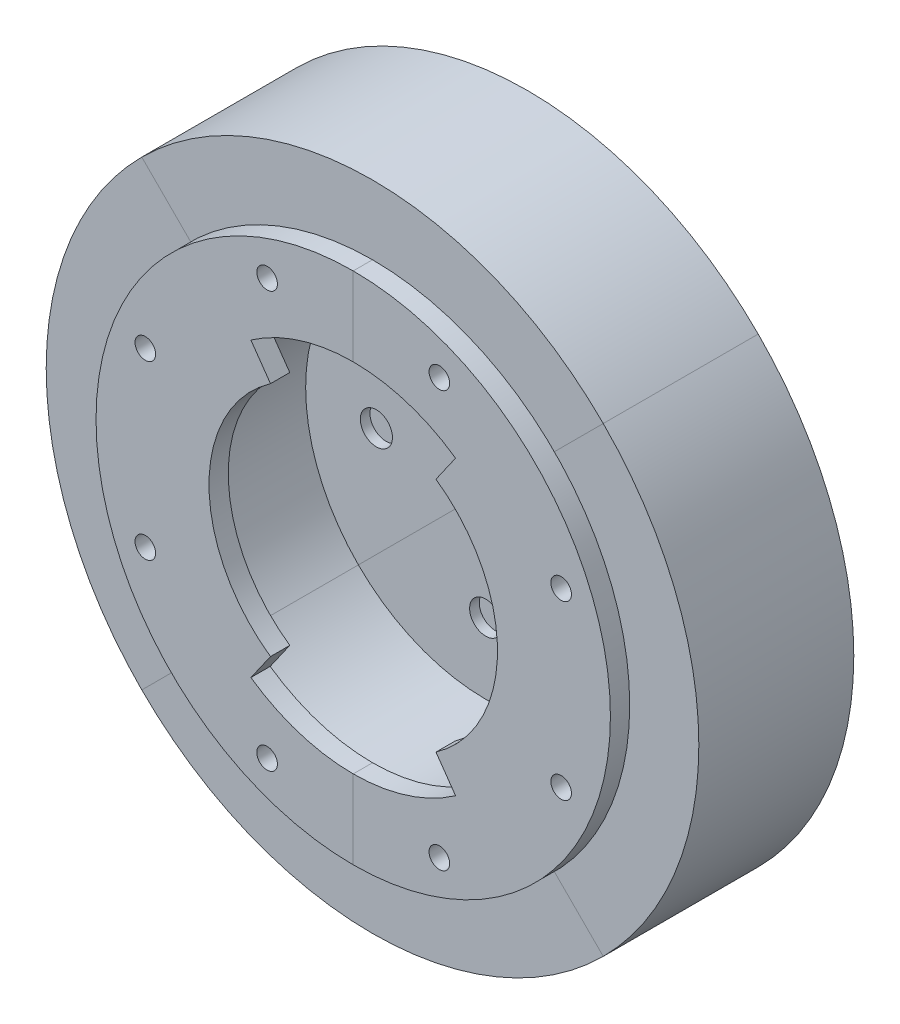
ISO-10303-21;
HEADER;
FILE_DESCRIPTION(('STEP AP214'),'2;1');
FILE_NAME('part.step','',(''),(''),'','','');
FILE_SCHEMA(('AUTOMOTIVE_DESIGN { 1 0 10303 214 1 1 1 1 }'));
ENDSEC;
DATA;
#1=APPLICATION_CONTEXT('core data for automotive mechanical design processes');
#2=APPLICATION_PROTOCOL_DEFINITION('international standard','automotive_design',2000,#1);
#3=PRODUCT_CONTEXT('',#1,'mechanical');
#4=PRODUCT('Part','Part','',(#3));
#5=PRODUCT_RELATED_PRODUCT_CATEGORY('part','',(#4));
#6=PRODUCT_DEFINITION_FORMATION('','',#4);
#7=PRODUCT_DEFINITION_CONTEXT('part definition',#1,'design');
#8=PRODUCT_DEFINITION('design','',#6,#7);
#9=PRODUCT_DEFINITION_SHAPE('','',#8);
#10=(LENGTH_UNIT() NAMED_UNIT(*) SI_UNIT(.MILLI.,.METRE.));
#11=(NAMED_UNIT(*) PLANE_ANGLE_UNIT() SI_UNIT($,.RADIAN.));
#12=(NAMED_UNIT(*) SI_UNIT($,.STERADIAN.) SOLID_ANGLE_UNIT());
#13=UNCERTAINTY_MEASURE_WITH_UNIT(LENGTH_MEASURE(1.E-05),#10,'distance_accuracy_value','');
#14=(GEOMETRIC_REPRESENTATION_CONTEXT(3) GLOBAL_UNCERTAINTY_ASSIGNED_CONTEXT((#13)) GLOBAL_UNIT_ASSIGNED_CONTEXT((#10,
#11,#12)) REPRESENTATION_CONTEXT('',''));
#15=CARTESIAN_POINT('',(0.,0.,0.));
#16=DIRECTION('',(0.,0.,1.));
#17=DIRECTION('',(1.,0.,0.));
#18=AXIS2_PLACEMENT_3D('',#15,#16,#17);
#19=CARTESIAN_POINT('',(85.3470283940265,-66.1529716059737,93.0029716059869));
#20=DIRECTION('',(0.,0.,1.));
#21=DIRECTION('',(1.,0.,0.));
#22=AXIS2_PLACEMENT_3D('',#19,#20,#21);
#23=PLANE('',#22);
#24=CARTESIAN_POINT('',(71.9531082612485,-98.4887552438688,93.0029716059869));
#25=DIRECTION('',(0.,0.,1.));
#26=DIRECTION('',(1.,0.,0.));
#27=AXIS2_PLACEMENT_3D('',#24,#25,#26);
#28=CIRCLE('',#27,1.6);
#29=CARTESIAN_POINT('',(73.5531082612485,-98.4887552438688,93.0029716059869));
#30=VERTEX_POINT('',#29);
#31=EDGE_CURVE('P0_E137',#30,#30,#28,.F.);
#32=ORIENTED_EDGE('',*,*,#31,.T.);
#33=EDGE_LOOP('',(#32));
#34=FACE_BOUND('',#33,.T.);
#35=CARTESIAN_POINT('',(53.0112447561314,-52.7590514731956,93.0029716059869));
#36=DIRECTION('',(0.,0.,1.));
#37=DIRECTION('',(1.,0.,0.));
#38=AXIS2_PLACEMENT_3D('',#35,#36,#37);
#39=CIRCLE('',#38,1.6);
#40=CARTESIAN_POINT('',(54.6112447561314,-52.7590514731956,93.0029716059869));
#41=VERTEX_POINT('',#40);
#42=EDGE_CURVE('P0_E140',#41,#41,#39,.F.);
#43=ORIENTED_EDGE('',*,*,#42,.T.);
#44=EDGE_LOOP('',(#43));
#45=FACE_BOUND('',#44,.T.);
#46=CARTESIAN_POINT('',(71.9531082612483,-33.8171879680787,93.0029716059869));
#47=DIRECTION('',(0.,0.,1.));
#48=DIRECTION('',(1.,0.,0.));
#49=AXIS2_PLACEMENT_3D('',#46,#47,#48);
#50=CIRCLE('',#49,1.6);
#51=CARTESIAN_POINT('',(73.5531082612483,-33.8171879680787,93.0029716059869));
#52=VERTEX_POINT('',#51);
#53=EDGE_CURVE('P0_E143',#52,#52,#50,.F.);
#54=ORIENTED_EDGE('',*,*,#53,.T.);
#55=EDGE_LOOP('',(#54));
#56=FACE_BOUND('',#55,.T.);
#57=CARTESIAN_POINT('',(53.0112447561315,-79.5468917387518,93.0029716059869));
#58=DIRECTION('',(0.,0.,1.));
#59=DIRECTION('',(1.,0.,0.));
#60=AXIS2_PLACEMENT_3D('',#57,#58,#59);
#61=CIRCLE('',#60,1.6);
#62=CARTESIAN_POINT('',(54.6112447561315,-79.5468917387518,93.0029716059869));
#63=VERTEX_POINT('',#62);
#64=EDGE_CURVE('P0_E146',#63,#63,#61,.F.);
#65=ORIENTED_EDGE('',*,*,#64,.T.);
#66=EDGE_LOOP('',(#65));
#67=FACE_BOUND('',#66,.T.);
#68=DIRECTION('',(0.573576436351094,-0.819152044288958,0.));
#69=VECTOR('',#68,1.);
#70=CARTESIAN_POINT('',(101.263774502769,-88.88444083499,93.0029716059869));
#71=LINE('',#70,#69);
#72=CARTESIAN_POINT('',(72.4790548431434,-47.7756008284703,93.0029716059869));
#73=VERTEX_POINT('',#72);
#74=CARTESIAN_POINT('',(69.4302822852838,-43.4215023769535,93.0029716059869));
#75=VERTEX_POINT('',#74);
#76=EDGE_CURVE('P0_E85',#73,#75,#71,.F.);
#77=ORIENTED_EDGE('',*,*,#76,.T.);
#78=CARTESIAN_POINT('',(85.3470283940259,-66.1529716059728,93.002971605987));
#79=DIRECTION('',(0.,0.,1.));
#80=DIRECTION('',(1.,0.,0.));
#81=AXIS2_PLACEMENT_3D('',#78,#79,#80);
#82=CIRCLE('',#81,27.75);
#83=CARTESIAN_POINT('',(85.3470283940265,-38.4029716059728,93.0029716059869));
#84=VERTEX_POINT('',#83);
#85=EDGE_CURVE('P0_E19',#75,#84,#82,.F.);
#86=ORIENTED_EDGE('',*,*,#85,.T.);
#87=DIRECTION('',(0.,1.,0.));
#88=VECTOR('',#87,1.);
#89=CARTESIAN_POINT('',(85.3470283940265,-66.1529716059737,93.0029716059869));
#90=LINE('',#89,#88);
#91=CARTESIAN_POINT('',(85.3470283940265,-26.1529716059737,93.0029716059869));
#92=VERTEX_POINT('',#91);
#93=EDGE_CURVE('P0_E82',#84,#92,#90,.T.);
#94=ORIENTED_EDGE('',*,*,#93,.T.);
#95=CARTESIAN_POINT('',(85.3470283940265,-66.1529716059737,93.0029716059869));
#96=DIRECTION('',(0.,0.,1.));
#97=DIRECTION('',(1.,0.,0.));
#98=AXIS2_PLACEMENT_3D('',#95,#96,#97);
#99=CIRCLE('',#98,40.);
#100=CARTESIAN_POINT('',(85.3470283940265,-106.152971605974,93.0029716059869));
#101=VERTEX_POINT('',#100);
#102=EDGE_CURVE('P0_E149',#101,#92,#99,.F.);
#103=ORIENTED_EDGE('',*,*,#102,.F.);
#104=DIRECTION('',(0.,1.,0.));
#105=VECTOR('',#104,1.);
#106=CARTESIAN_POINT('',(85.3470283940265,-66.1529716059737,93.0029716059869));
#107=LINE('',#106,#105);
#108=CARTESIAN_POINT('',(85.3470283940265,-93.9029716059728,93.0029716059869));
#109=VERTEX_POINT('',#108);
#110=EDGE_CURVE('P0_E104',#101,#109,#107,.T.);
#111=ORIENTED_EDGE('',*,*,#110,.T.);
#112=CARTESIAN_POINT('',(85.3470283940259,-66.1529716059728,93.0029716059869));
#113=DIRECTION('',(0.,0.,1.));
#114=DIRECTION('',(1.,0.,0.));
#115=AXIS2_PLACEMENT_3D('',#112,#113,#114);
#116=CIRCLE('',#115,27.75);
#117=CARTESIAN_POINT('',(69.4302822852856,-88.8844408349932,93.0029716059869));
#118=VERTEX_POINT('',#117);
#119=EDGE_CURVE('P0_E151',#109,#118,#116,.F.);
#120=ORIENTED_EDGE('',*,*,#119,.T.);
#121=DIRECTION('',(0.573576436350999,0.819152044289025,0.));
#122=VECTOR('',#121,1.);
#123=CARTESIAN_POINT('',(75.3470283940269,-80.4344516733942,93.0029716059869));
#124=LINE('',#123,#122);
#125=CARTESIAN_POINT('',(72.479054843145,-84.5303423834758,93.0029716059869));
#126=VERTEX_POINT('',#125);
#127=EDGE_CURVE('P0_E108',#126,#118,#124,.F.);
#128=ORIENTED_EDGE('',*,*,#127,.F.);
#129=CARTESIAN_POINT('',(85.347028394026,-66.1529716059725,93.0029716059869));
#130=DIRECTION('',(0.,0.,-1.));
#131=DIRECTION('',(0.,1.,0.));
#132=AXIS2_PLACEMENT_3D('',#129,#130,#131);
#133=CIRCLE('',#132,22.4346272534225);
#134=EDGE_CURVE('P0_E113',#126,#73,#133,.T.);
#135=ORIENTED_EDGE('',*,*,#134,.T.);
#136=EDGE_LOOP('',(#77,#86,#94,#103,#111,#120,#128,#135));
#137=FACE_BOUND('',#136,.T.);
#138=ADVANCED_FACE('P0_F16',(#34,#45,#56,#67,#137),#23,.T.);
#139=CARTESIAN_POINT('',(85.3470283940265,-66.1529716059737,91.5029716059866));
#140=DIRECTION('',(-1.,0.,0.));
#141=DIRECTION('',(0.,0.,1.));
#142=AXIS2_PLACEMENT_3D('',#139,#140,#141);
#143=PLANE('',#142);
#144=DIRECTION('',(0.,1.,0.));
#145=VECTOR('',#144,1.);
#146=CARTESIAN_POINT('',(85.3470283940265,-66.1529716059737,90.0029716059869));
#147=LINE('',#146,#145);
#148=CARTESIAN_POINT('',(85.3470283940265,-26.1529716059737,90.0029716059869));
#149=VERTEX_POINT('',#148);
#150=CARTESIAN_POINT('',(85.3470283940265,-38.4029716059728,90.0029716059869));
#151=VERTEX_POINT('',#150);
#152=EDGE_CURVE('P0_E136',#149,#151,#147,.F.);
#153=ORIENTED_EDGE('',*,*,#152,.F.);
#154=DIRECTION('',(0.,0.,1.));
#155=VECTOR('',#154,1.);
#156=CARTESIAN_POINT('',(85.3470283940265,-26.1529716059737,91.5029716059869));
#157=LINE('',#156,#155);
#158=EDGE_CURVE('P0_E92',#92,#149,#157,.F.);
#159=ORIENTED_EDGE('',*,*,#158,.F.);
#160=ORIENTED_EDGE('',*,*,#93,.F.);
#161=DIRECTION('',(0.,0.,1.));
#162=VECTOR('',#161,1.);
#163=CARTESIAN_POINT('',(85.3470283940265,-38.4029716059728,90.0029716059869));
#164=LINE('',#163,#162);
#165=EDGE_CURVE('P0_E87',#84,#151,#164,.F.);
#166=ORIENTED_EDGE('',*,*,#165,.T.);
#167=EDGE_LOOP('',(#153,#159,#160,#166));
#168=FACE_BOUND('',#167,.T.);
#169=ADVANCED_FACE('P0_F89',(#168),#143,.F.);
#170=CARTESIAN_POINT('',(85.3470283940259,-66.1529716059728,90.0029716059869));
#171=DIRECTION('',(0.,0.,1.));
#172=DIRECTION('',(1.,0.,0.));
#173=AXIS2_PLACEMENT_3D('',#170,#171,#172);
#174=CYLINDRICAL_SURFACE('',#173,27.75);
#175=ORIENTED_EDGE('',*,*,#85,.F.);
#176=DIRECTION('',(0.,0.,1.));
#177=VECTOR('',#176,1.);
#178=CARTESIAN_POINT('',(69.4302822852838,-43.4215023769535,110.002971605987));
#179=LINE('',#178,#177);
#180=CARTESIAN_POINT('',(69.4302822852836,-43.4215023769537,90.0029716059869));
#181=VERTEX_POINT('',#180);
#182=EDGE_CURVE('P0_E99',#75,#181,#179,.F.);
#183=ORIENTED_EDGE('',*,*,#182,.T.);
#184=CARTESIAN_POINT('',(85.3470283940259,-66.1529716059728,90.0029716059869));
#185=DIRECTION('',(0.,0.,1.));
#186=DIRECTION('',(1.,0.,0.));
#187=AXIS2_PLACEMENT_3D('',#184,#185,#186);
#188=CIRCLE('',#187,27.75);
#189=EDGE_CURVE('P0_E97',#151,#181,#188,.T.);
#190=ORIENTED_EDGE('',*,*,#189,.F.);
#191=ORIENTED_EDGE('',*,*,#165,.F.);
#192=EDGE_LOOP('',(#175,#183,#190,#191));
#193=FACE_BOUND('',#192,.T.);
#194=ADVANCED_FACE('P0_F95',(#193),#174,.F.);
#195=CARTESIAN_POINT('',(101.263774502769,-88.88444083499,110.002971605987));
#196=DIRECTION('',(-0.819152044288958,-0.573576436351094,0.));
#197=DIRECTION('',(0.573576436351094,-0.819152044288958,0.));
#198=AXIS2_PLACEMENT_3D('',#195,#196,#197);
#199=PLANE('',#198);
#200=DIRECTION('',(0.,0.,-1.));
#201=VECTOR('',#200,1.);
#202=CARTESIAN_POINT('',(72.4790548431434,-47.7756008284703,68.62235424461));
#203=LINE('',#202,#201);
#204=CARTESIAN_POINT('',(72.479054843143,-47.7756008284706,90.0029716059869));
#205=VERTEX_POINT('',#204);
#206=EDGE_CURVE('P0_E112',#73,#205,#203,.T.);
#207=ORIENTED_EDGE('',*,*,#206,.T.);
#208=DIRECTION('',(0.573576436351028,-0.819152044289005,0.));
#209=VECTOR('',#208,1.);
#210=CARTESIAN_POINT('',(69.4302822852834,-43.421502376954,90.0029716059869));
#211=LINE('',#210,#209);
#212=EDGE_CURVE('P0_E134',#181,#205,#211,.T.);
#213=ORIENTED_EDGE('',*,*,#212,.F.);
#214=ORIENTED_EDGE('',*,*,#182,.F.);
#215=ORIENTED_EDGE('',*,*,#76,.F.);
#216=EDGE_LOOP('',(#207,#213,#214,#215));
#217=FACE_BOUND('',#216,.T.);
#218=ADVANCED_FACE('P0_F184',(#217),#199,.F.);
#219=CARTESIAN_POINT('',(85.347028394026,-66.1529716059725,68.62235424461));
#220=DIRECTION('',(0.,0.,-1.));
#221=DIRECTION('',(0.,1.,0.));
#222=AXIS2_PLACEMENT_3D('',#219,#220,#221);
#223=CYLINDRICAL_SURFACE('',#222,22.4346272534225);
#224=ORIENTED_EDGE('',*,*,#134,.F.);
#225=DIRECTION('',(0.,0.,1.));
#226=VECTOR('',#225,1.);
#227=CARTESIAN_POINT('',(72.4790548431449,-84.5303423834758,110.002971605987));
#228=LINE('',#227,#226);
#229=CARTESIAN_POINT('',(72.4790548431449,-84.5303423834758,90.0029716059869));
#230=VERTEX_POINT('',#229);
#231=EDGE_CURVE('P0_E111',#230,#126,#228,.T.);
#232=ORIENTED_EDGE('',*,*,#231,.F.);
#233=CARTESIAN_POINT('',(85.347028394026,-66.1529716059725,90.0029716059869));
#234=DIRECTION('',(0.,0.,-1.));
#235=DIRECTION('',(0.,1.,0.));
#236=AXIS2_PLACEMENT_3D('',#233,#234,#235);
#237=CIRCLE('',#236,22.4346272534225);
#238=EDGE_CURVE('P0_E131',#205,#230,#237,.F.);
#239=ORIENTED_EDGE('',*,*,#238,.F.);
#240=ORIENTED_EDGE('',*,*,#206,.F.);
#241=EDGE_LOOP('',(#224,#232,#239,#240));
#242=FACE_BOUND('',#241,.T.);
#243=ADVANCED_FACE('P0_F183',(#242),#223,.F.);
#244=CARTESIAN_POINT('',(75.3470283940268,-80.4344516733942,110.002971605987));
#245=DIRECTION('',(0.819152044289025,-0.573576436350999,0.));
#246=DIRECTION('',(0.573576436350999,0.819152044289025,0.));
#247=AXIS2_PLACEMENT_3D('',#244,#245,#246);
#248=PLANE('',#247);
#249=DIRECTION('',(-0.573576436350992,-0.819152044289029,0.));
#250=VECTOR('',#249,1.);
#251=CARTESIAN_POINT('',(72.4790548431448,-84.5303423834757,90.0029716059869));
#252=LINE('',#251,#250);
#253=CARTESIAN_POINT('',(69.4302822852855,-88.8844408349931,90.0029716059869));
#254=VERTEX_POINT('',#253);
#255=EDGE_CURVE('P0_E130',#230,#254,#252,.T.);
#256=ORIENTED_EDGE('',*,*,#255,.F.);
#257=ORIENTED_EDGE('',*,*,#231,.T.);
#258=ORIENTED_EDGE('',*,*,#127,.T.);
#259=DIRECTION('',(0.,0.,1.));
#260=VECTOR('',#259,1.);
#261=CARTESIAN_POINT('',(69.4302822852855,-88.8844408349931,90.0029716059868));
#262=LINE('',#261,#260);
#263=EDGE_CURVE('P0_E106',#118,#254,#262,.F.);
#264=ORIENTED_EDGE('',*,*,#263,.T.);
#265=EDGE_LOOP('',(#256,#257,#258,#264));
#266=FACE_BOUND('',#265,.T.);
#267=ADVANCED_FACE('P0_F181',(#266),#248,.T.);
#268=CARTESIAN_POINT('',(85.3470283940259,-66.1529716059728,90.0029716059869));
#269=DIRECTION('',(0.,0.,1.));
#270=DIRECTION('',(1.,0.,0.));
#271=AXIS2_PLACEMENT_3D('',#268,#269,#270);
#272=CYLINDRICAL_SURFACE('',#271,27.75);
#273=CARTESIAN_POINT('',(85.3470283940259,-66.1529716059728,90.002971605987));
#274=DIRECTION('',(0.,0.,1.));
#275=DIRECTION('',(1.,0.,0.));
#276=AXIS2_PLACEMENT_3D('',#273,#274,#275);
#277=CIRCLE('',#276,27.75);
#278=CARTESIAN_POINT('',(85.3470283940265,-93.9029716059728,90.0029716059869));
#279=VERTEX_POINT('',#278);
#280=EDGE_CURVE('P0_E127',#254,#279,#277,.T.);
#281=ORIENTED_EDGE('',*,*,#280,.F.);
#282=ORIENTED_EDGE('',*,*,#263,.F.);
#283=ORIENTED_EDGE('',*,*,#119,.F.);
#284=DIRECTION('',(0.,0.,1.));
#285=VECTOR('',#284,1.);
#286=CARTESIAN_POINT('',(85.3470283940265,-93.9029716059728,91.5029716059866));
#287=LINE('',#286,#285);
#288=EDGE_CURVE('P0_E105',#109,#279,#287,.F.);
#289=ORIENTED_EDGE('',*,*,#288,.T.);
#290=EDGE_LOOP('',(#281,#282,#283,#289));
#291=FACE_BOUND('',#290,.T.);
#292=ADVANCED_FACE('P0_F177',(#291),#272,.F.);
#293=CARTESIAN_POINT('',(85.3470283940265,-66.1529716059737,91.5029716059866));
#294=DIRECTION('',(-1.,0.,0.));
#295=DIRECTION('',(0.,0.,1.));
#296=AXIS2_PLACEMENT_3D('',#293,#294,#295);
#297=PLANE('',#296);
#298=ORIENTED_EDGE('',*,*,#110,.F.);
#299=DIRECTION('',(0.,0.,1.));
#300=VECTOR('',#299,1.);
#301=CARTESIAN_POINT('',(85.3470283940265,-106.152971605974,91.5029716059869));
#302=LINE('',#301,#300);
#303=CARTESIAN_POINT('',(85.3470283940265,-106.152971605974,90.0029716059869));
#304=VERTEX_POINT('',#303);
#305=EDGE_CURVE('P0_E34',#304,#101,#302,.T.);
#306=ORIENTED_EDGE('',*,*,#305,.F.);
#307=DIRECTION('',(0.,1.,0.));
#308=VECTOR('',#307,1.);
#309=CARTESIAN_POINT('',(85.3470283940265,-66.1529716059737,90.0029716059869));
#310=LINE('',#309,#308);
#311=EDGE_CURVE('P0_E126',#279,#304,#310,.F.);
#312=ORIENTED_EDGE('',*,*,#311,.F.);
#313=ORIENTED_EDGE('',*,*,#288,.F.);
#314=EDGE_LOOP('',(#298,#306,#312,#313));
#315=FACE_BOUND('',#314,.T.);
#316=ADVANCED_FACE('P0_F174',(#315),#297,.F.);
#317=CARTESIAN_POINT('',(85.3470283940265,-66.1529716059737,91.5029716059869));
#318=DIRECTION('',(0.,0.,1.));
#319=DIRECTION('',(1.,0.,0.));
#320=AXIS2_PLACEMENT_3D('',#317,#318,#319);
#321=CYLINDRICAL_SURFACE('',#320,40.);
#322=ORIENTED_EDGE('',*,*,#305,.T.);
#323=ORIENTED_EDGE('',*,*,#102,.T.);
#324=ORIENTED_EDGE('',*,*,#158,.T.);
#325=CARTESIAN_POINT('',(85.3470283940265,-66.1529716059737,90.0029716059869));
#326=DIRECTION('',(0.,0.,1.));
#327=DIRECTION('',(1.,0.,0.));
#328=AXIS2_PLACEMENT_3D('',#325,#326,#327);
#329=CIRCLE('',#328,40.);
#330=EDGE_CURVE('P0_E123',#304,#149,#329,.F.);
#331=ORIENTED_EDGE('',*,*,#330,.F.);
#332=EDGE_LOOP('',(#322,#323,#324,#331));
#333=FACE_BOUND('',#332,.T.);
#334=ADVANCED_FACE('P0_F216',(#333),#321,.T.);
#335=CARTESIAN_POINT('',(53.0112447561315,-79.5468917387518,98.3773697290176));
#336=DIRECTION('',(0.,0.,1.));
#337=DIRECTION('',(1.,0.,0.));
#338=AXIS2_PLACEMENT_3D('',#335,#336,#337);
#339=CYLINDRICAL_SURFACE('',#338,1.6);
#340=ORIENTED_EDGE('',*,*,#64,.F.);
#341=EDGE_LOOP('',(#340));
#342=FACE_BOUND('',#341,.T.);
#343=CARTESIAN_POINT('',(53.0112447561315,-79.5468917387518,90.0029716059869));
#344=DIRECTION('',(0.,0.,1.));
#345=DIRECTION('',(1.,0.,0.));
#346=AXIS2_PLACEMENT_3D('',#343,#344,#345);
#347=CIRCLE('',#346,1.6);
#348=CARTESIAN_POINT('',(54.6112447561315,-79.5468917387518,90.0029716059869));
#349=VERTEX_POINT('',#348);
#350=EDGE_CURVE('P0_E120',#349,#349,#347,.T.);
#351=ORIENTED_EDGE('',*,*,#350,.F.);
#352=EDGE_LOOP('',(#351));
#353=FACE_BOUND('',#352,.T.);
#354=ADVANCED_FACE('P0_F212',(#342,#353),#339,.F.);
#355=CARTESIAN_POINT('',(71.9531082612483,-33.8171879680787,98.3773697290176));
#356=DIRECTION('',(0.,0.,1.));
#357=DIRECTION('',(1.,0.,0.));
#358=AXIS2_PLACEMENT_3D('',#355,#356,#357);
#359=CYLINDRICAL_SURFACE('',#358,1.6);
#360=ORIENTED_EDGE('',*,*,#53,.F.);
#361=EDGE_LOOP('',(#360));
#362=FACE_BOUND('',#361,.T.);
#363=CARTESIAN_POINT('',(71.9531082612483,-33.8171879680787,90.0029716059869));
#364=DIRECTION('',(0.,0.,1.));
#365=DIRECTION('',(1.,0.,0.));
#366=AXIS2_PLACEMENT_3D('',#363,#364,#365);
#367=CIRCLE('',#366,1.6);
#368=CARTESIAN_POINT('',(73.5531082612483,-33.8171879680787,90.0029716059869));
#369=VERTEX_POINT('',#368);
#370=EDGE_CURVE('P0_E117',#369,#369,#367,.T.);
#371=ORIENTED_EDGE('',*,*,#370,.F.);
#372=EDGE_LOOP('',(#371));
#373=FACE_BOUND('',#372,.T.);
#374=ADVANCED_FACE('P0_F208',(#362,#373),#359,.F.);
#375=CARTESIAN_POINT('',(53.0112447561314,-52.7590514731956,98.3773697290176));
#376=DIRECTION('',(0.,0.,1.));
#377=DIRECTION('',(1.,0.,0.));
#378=AXIS2_PLACEMENT_3D('',#375,#376,#377);
#379=CYLINDRICAL_SURFACE('',#378,1.6);
#380=ORIENTED_EDGE('',*,*,#42,.F.);
#381=EDGE_LOOP('',(#380));
#382=FACE_BOUND('',#381,.T.);
#383=CARTESIAN_POINT('',(53.0112447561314,-52.7590514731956,90.0029716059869));
#384=DIRECTION('',(0.,0.,1.));
#385=DIRECTION('',(1.,0.,0.));
#386=AXIS2_PLACEMENT_3D('',#383,#384,#385);
#387=CIRCLE('',#386,1.6);
#388=CARTESIAN_POINT('',(54.6112447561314,-52.7590514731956,90.0029716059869));
#389=VERTEX_POINT('',#388);
#390=EDGE_CURVE('P0_E25',#389,#389,#387,.T.);
#391=ORIENTED_EDGE('',*,*,#390,.F.);
#392=EDGE_LOOP('',(#391));
#393=FACE_BOUND('',#392,.T.);
#394=ADVANCED_FACE('P0_F201',(#382,#393),#379,.F.);
#395=CARTESIAN_POINT('',(71.9531082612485,-98.4887552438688,98.3773697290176));
#396=DIRECTION('',(0.,0.,1.));
#397=DIRECTION('',(1.,0.,0.));
#398=AXIS2_PLACEMENT_3D('',#395,#396,#397);
#399=CYLINDRICAL_SURFACE('',#398,1.6);
#400=ORIENTED_EDGE('',*,*,#31,.F.);
#401=EDGE_LOOP('',(#400));
#402=FACE_BOUND('',#401,.T.);
#403=CARTESIAN_POINT('',(71.9531082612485,-98.4887552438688,90.0029716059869));
#404=DIRECTION('',(0.,0.,1.));
#405=DIRECTION('',(1.,0.,0.));
#406=AXIS2_PLACEMENT_3D('',#403,#404,#405);
#407=CIRCLE('',#406,1.6);
#408=CARTESIAN_POINT('',(73.5531082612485,-98.4887552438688,90.0029716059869));
#409=VERTEX_POINT('',#408);
#410=EDGE_CURVE('P0_E11',#409,#409,#407,.T.);
#411=ORIENTED_EDGE('',*,*,#410,.F.);
#412=EDGE_LOOP('',(#411));
#413=FACE_BOUND('',#412,.T.);
#414=ADVANCED_FACE('P0_F195',(#402,#413),#399,.F.);
#415=CARTESIAN_POINT('',(85.3470283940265,-66.1529716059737,90.0029716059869));
#416=DIRECTION('',(0.,0.,-1.));
#417=DIRECTION('',(-1.,0.,0.));
#418=AXIS2_PLACEMENT_3D('',#415,#416,#417);
#419=PLANE('',#418);
#420=ORIENTED_EDGE('',*,*,#410,.T.);
#421=EDGE_LOOP('',(#420));
#422=FACE_BOUND('',#421,.T.);
#423=ORIENTED_EDGE('',*,*,#390,.T.);
#424=EDGE_LOOP('',(#423));
#425=FACE_BOUND('',#424,.T.);
#426=ORIENTED_EDGE('',*,*,#370,.T.);
#427=EDGE_LOOP('',(#426));
#428=FACE_BOUND('',#427,.T.);
#429=ORIENTED_EDGE('',*,*,#350,.T.);
#430=EDGE_LOOP('',(#429));
#431=FACE_BOUND('',#430,.T.);
#432=ORIENTED_EDGE('',*,*,#311,.T.);
#433=ORIENTED_EDGE('',*,*,#330,.T.);
#434=ORIENTED_EDGE('',*,*,#152,.T.);
#435=ORIENTED_EDGE('',*,*,#189,.T.);
#436=ORIENTED_EDGE('',*,*,#212,.T.);
#437=ORIENTED_EDGE('',*,*,#238,.T.);
#438=ORIENTED_EDGE('',*,*,#255,.T.);
#439=ORIENTED_EDGE('',*,*,#280,.T.);
#440=EDGE_LOOP('',(#432,#433,#434,#435,#436,#437,#438,#439));
#441=FACE_BOUND('',#440,.T.);
#442=ADVANCED_FACE('P0_F171',(#422,#425,#428,#431,#441),#419,.T.);
#443=CLOSED_SHELL('',(#138,#169,#194,#218,#243,#267,#292,#316,#334,#354,#374,#394,#414,#442));
#444=MANIFOLD_SOLID_BREP('P0_B1',#443);
#445=CARTESIAN_POINT('',(85.3470283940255,-49.1529716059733,70.9029716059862));
#446=DIRECTION('',(0.,0.,-1.));
#447=DIRECTION('',(-1.,0.,0.));
#448=AXIS2_PLACEMENT_3D('',#445,#446,#447);
#449=PLANE('',#448);
#450=CARTESIAN_POINT('',(85.3470283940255,-49.1529716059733,70.9029716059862));
#451=DIRECTION('',(0.,0.,1.));
#452=DIRECTION('',(1.,0.,0.));
#453=AXIS2_PLACEMENT_3D('',#450,#451,#452);
#454=CIRCLE('',#453,2.5);
#455=CARTESIAN_POINT('',(87.8470283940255,-49.1529716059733,70.9029716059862));
#456=VERTEX_POINT('',#455);
#457=EDGE_CURVE('P1_E27',#456,#456,#454,.T.);
#458=ORIENTED_EDGE('',*,*,#457,.T.);
#459=EDGE_LOOP('',(#458));
#460=FACE_BOUND('',#459,.T.);
#461=ADVANCED_FACE('P1_F24',(#460),#449,.F.);
#462=CARTESIAN_POINT('',(71.9531082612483,-33.8171879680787,80.0029716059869));
#463=DIRECTION('',(0.,0.,-1.));
#464=DIRECTION('',(-1.,0.,0.));
#465=AXIS2_PLACEMENT_3D('',#462,#463,#464);
#466=PLANE('',#465);
#467=CARTESIAN_POINT('',(71.9531082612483,-33.8171879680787,80.0029716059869));
#468=DIRECTION('',(0.,0.,-1.));
#469=DIRECTION('',(-1.,0.,0.));
#470=AXIS2_PLACEMENT_3D('',#467,#468,#469);
#471=CIRCLE('',#470,1.5);
#472=CARTESIAN_POINT('',(70.4531082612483,-33.8171879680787,80.0029716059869));
#473=VERTEX_POINT('',#472);
#474=EDGE_CURVE('P1_E111',#473,#473,#471,.F.);
#475=ORIENTED_EDGE('',*,*,#474,.T.);
#476=EDGE_LOOP('',(#475));
#477=FACE_BOUND('',#476,.T.);
#478=ADVANCED_FACE('P1_F133',(#477),#466,.F.);
#479=CARTESIAN_POINT('',(98.7409485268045,-33.8171879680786,80.0029716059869));
#480=DIRECTION('',(0.,0.,-1.));
#481=DIRECTION('',(-1.,0.,0.));
#482=AXIS2_PLACEMENT_3D('',#479,#480,#481);
#483=PLANE('',#482);
#484=CARTESIAN_POINT('',(98.7409485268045,-33.8171879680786,80.0029716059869));
#485=DIRECTION('',(0.,0.,-1.));
#486=DIRECTION('',(-1.,0.,0.));
#487=AXIS2_PLACEMENT_3D('',#484,#485,#486);
#488=CIRCLE('',#487,1.5);
#489=CARTESIAN_POINT('',(97.2409485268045,-33.8171879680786,80.0029716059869));
#490=VERTEX_POINT('',#489);
#491=EDGE_CURVE('P1_E79',#490,#490,#488,.F.);
#492=ORIENTED_EDGE('',*,*,#491,.T.);
#493=EDGE_LOOP('',(#492));
#494=FACE_BOUND('',#493,.T.);
#495=ADVANCED_FACE('P1_F122',(#494),#483,.F.);
#496=CARTESIAN_POINT('',(85.3470283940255,-49.1529716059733,74.4029716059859));
#497=DIRECTION('',(0.,0.,1.));
#498=DIRECTION('',(1.,0.,0.));
#499=AXIS2_PLACEMENT_3D('',#496,#497,#498);
#500=CYLINDRICAL_SURFACE('',#499,2.5);
#501=CARTESIAN_POINT('',(85.3470283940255,-49.1529716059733,72.4029716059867));
#502=DIRECTION('',(0.,0.,1.));
#503=DIRECTION('',(1.,0.,0.));
#504=AXIS2_PLACEMENT_3D('',#501,#502,#503);
#505=CIRCLE('',#504,2.5);
#506=CARTESIAN_POINT('',(87.8470283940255,-49.1529716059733,72.4029716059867));
#507=VERTEX_POINT('',#506);
#508=EDGE_CURVE('P1_E78',#507,#507,#505,.F.);
#509=ORIENTED_EDGE('',*,*,#508,.F.);
#510=EDGE_LOOP('',(#509));
#511=FACE_BOUND('',#510,.T.);
#512=ORIENTED_EDGE('',*,*,#457,.F.);
#513=EDGE_LOOP('',(#512));
#514=FACE_BOUND('',#513,.T.);
#515=ADVANCED_FACE('P1_F119',(#511,#514),#500,.F.);
#516=CARTESIAN_POINT('',(71.9531082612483,-33.8171879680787,85.0029716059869));
#517=DIRECTION('',(0.,0.,-1.));
#518=DIRECTION('',(-1.,0.,0.));
#519=AXIS2_PLACEMENT_3D('',#516,#517,#518);
#520=CYLINDRICAL_SURFACE('',#519,1.5);
#521=ORIENTED_EDGE('',*,*,#474,.F.);
#522=EDGE_LOOP('',(#521));
#523=FACE_BOUND('',#522,.T.);
#524=CARTESIAN_POINT('',(71.9531082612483,-33.8171879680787,90.0029716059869));
#525=DIRECTION('',(0.,0.,-1.));
#526=DIRECTION('',(-1.,0.,0.));
#527=AXIS2_PLACEMENT_3D('',#524,#525,#526);
#528=CIRCLE('',#527,1.5);
#529=CARTESIAN_POINT('',(70.4531082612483,-33.8171879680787,90.0029716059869));
#530=VERTEX_POINT('',#529);
#531=EDGE_CURVE('P1_E95',#530,#530,#528,.T.);
#532=ORIENTED_EDGE('',*,*,#531,.F.);
#533=EDGE_LOOP('',(#532));
#534=FACE_BOUND('',#533,.T.);
#535=ADVANCED_FACE('P1_F121',(#523,#534),#520,.F.);
#536=CARTESIAN_POINT('',(98.7409485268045,-33.8171879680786,85.0029716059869));
#537=DIRECTION('',(0.,0.,-1.));
#538=DIRECTION('',(-1.,0.,0.));
#539=AXIS2_PLACEMENT_3D('',#536,#537,#538);
#540=CYLINDRICAL_SURFACE('',#539,1.5);
#541=ORIENTED_EDGE('',*,*,#491,.F.);
#542=EDGE_LOOP('',(#541));
#543=FACE_BOUND('',#542,.T.);
#544=CARTESIAN_POINT('',(98.7409485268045,-33.8171879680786,90.0029716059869));
#545=DIRECTION('',(0.,0.,-1.));
#546=DIRECTION('',(-1.,0.,0.));
#547=AXIS2_PLACEMENT_3D('',#544,#545,#546);
#548=CIRCLE('',#547,1.5);
#549=CARTESIAN_POINT('',(97.2409485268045,-33.8171879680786,90.0029716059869));
#550=VERTEX_POINT('',#549);
#551=EDGE_CURVE('P1_E92',#550,#550,#548,.T.);
#552=ORIENTED_EDGE('',*,*,#551,.F.);
#553=EDGE_LOOP('',(#552));
#554=FACE_BOUND('',#553,.T.);
#555=ADVANCED_FACE('P1_F130',(#543,#554),#540,.F.);
#556=CARTESIAN_POINT('',(85.3470283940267,-66.1529716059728,81.7029716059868));
#557=DIRECTION('',(0.,0.,-1.));
#558=DIRECTION('',(0.,1.,0.));
#559=AXIS2_PLACEMENT_3D('',#556,#557,#558);
#560=CYLINDRICAL_SURFACE('',#559,28.);
#561=CARTESIAN_POINT('',(85.3470283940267,-66.1529716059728,90.0029716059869));
#562=DIRECTION('',(0.,0.,-1.));
#563=DIRECTION('',(0.,1.,0.));
#564=AXIS2_PLACEMENT_3D('',#561,#562,#563);
#565=CIRCLE('',#564,28.);
#566=CARTESIAN_POINT('',(65.5480385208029,-46.3539817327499,90.0029716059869));
#567=VERTEX_POINT('',#566);
#568=CARTESIAN_POINT('',(105.14601826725,-46.3539817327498,90.0029716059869));
#569=VERTEX_POINT('',#568);
#570=EDGE_CURVE('P1_E106',#567,#569,#565,.T.);
#571=ORIENTED_EDGE('',*,*,#570,.F.);
#572=DIRECTION('',(0.,0.,1.));
#573=VECTOR('',#572,1.);
#574=CARTESIAN_POINT('',(65.5480385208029,-46.3539817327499,77.9529716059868));
#575=LINE('',#574,#573);
#576=CARTESIAN_POINT('',(65.5480385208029,-46.3539817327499,72.4029716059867));
#577=VERTEX_POINT('',#576);
#578=EDGE_CURVE('P1_E74',#567,#577,#575,.F.);
#579=ORIENTED_EDGE('',*,*,#578,.T.);
#580=CARTESIAN_POINT('',(85.3470283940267,-66.1529716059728,72.4029716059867));
#581=DIRECTION('',(0.,0.,-1.));
#582=DIRECTION('',(0.,1.,0.));
#583=AXIS2_PLACEMENT_3D('',#580,#581,#582);
#584=CIRCLE('',#583,28.);
#585=CARTESIAN_POINT('',(105.14601826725,-46.3539817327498,72.4029716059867));
#586=VERTEX_POINT('',#585);
#587=EDGE_CURVE('P1_E67',#586,#577,#584,.F.);
#588=ORIENTED_EDGE('',*,*,#587,.F.);
#589=DIRECTION('',(0.,0.,1.));
#590=VECTOR('',#589,1.);
#591=CARTESIAN_POINT('',(105.14601826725,-46.3539817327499,77.9529716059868));
#592=LINE('',#591,#590);
#593=EDGE_CURVE('P1_E71',#569,#586,#592,.F.);
#594=ORIENTED_EDGE('',*,*,#593,.F.);
#595=EDGE_LOOP('',(#571,#579,#588,#594));
#596=FACE_BOUND('',#595,.T.);
#597=ADVANCED_FACE('P1_F69',(#596),#560,.F.);
#598=CARTESIAN_POINT('',(85.3470283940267,-66.1529716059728,72.4029716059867));
#599=DIRECTION('',(0.,0.,1.));
#600=DIRECTION('',(1.,0.,0.));
#601=AXIS2_PLACEMENT_3D('',#598,#599,#600);
#602=PLANE('',#601);
#603=ORIENTED_EDGE('',*,*,#508,.T.);
#604=EDGE_LOOP('',(#603));
#605=FACE_BOUND('',#604,.T.);
#606=ORIENTED_EDGE('',*,*,#587,.T.);
#607=DIRECTION('',(-0.707106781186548,0.707106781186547,0.));
#608=VECTOR('',#607,1.);
#609=CARTESIAN_POINT('',(85.3470283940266,-66.1529716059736,72.4029716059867));
#610=LINE('',#609,#608);
#611=CARTESIAN_POINT('',(85.3470283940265,-66.1529716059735,72.4029716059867));
#612=VERTEX_POINT('',#611);
#613=EDGE_CURVE('P1_E84',#577,#612,#610,.F.);
#614=ORIENTED_EDGE('',*,*,#613,.T.);
#615=DIRECTION('',(0.707106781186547,0.707106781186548,0.));
#616=VECTOR('',#615,1.);
#617=CARTESIAN_POINT('',(92.7791938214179,-58.7208061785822,72.4029716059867));
#618=LINE('',#617,#616);
#619=EDGE_CURVE('P1_E82',#586,#612,#618,.F.);
#620=ORIENTED_EDGE('',*,*,#619,.F.);
#621=EDGE_LOOP('',(#606,#614,#620));
#622=FACE_BOUND('',#621,.T.);
#623=ADVANCED_FACE('P1_F83',(#605,#622),#602,.T.);
#624=CARTESIAN_POINT('',(85.3470283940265,-66.1529716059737,90.0029716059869));
#625=DIRECTION('',(0.,0.,1.));
#626=DIRECTION('',(1.,0.,0.));
#627=AXIS2_PLACEMENT_3D('',#624,#625,#626);
#628=PLANE('',#627);
#629=ORIENTED_EDGE('',*,*,#551,.T.);
#630=EDGE_LOOP('',(#629));
#631=FACE_BOUND('',#630,.T.);
#632=ORIENTED_EDGE('',*,*,#531,.T.);
#633=EDGE_LOOP('',(#632));
#634=FACE_BOUND('',#633,.T.);
#635=DIRECTION('',(-0.707106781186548,0.707106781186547,0.));
#636=VECTOR('',#635,1.);
#637=CARTESIAN_POINT('',(85.3470283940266,-66.1529716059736,90.0029716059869));
#638=LINE('',#637,#636);
#639=CARTESIAN_POINT('',(49.4613592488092,-30.2673024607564,90.0029716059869));
#640=VERTEX_POINT('',#639);
#641=EDGE_CURVE('P1_E175',#640,#567,#638,.F.);
#642=ORIENTED_EDGE('',*,*,#641,.T.);
#643=ORIENTED_EDGE('',*,*,#570,.T.);
#644=DIRECTION('',(0.707106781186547,0.707106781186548,0.));
#645=VECTOR('',#644,1.);
#646=CARTESIAN_POINT('',(92.7791938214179,-58.7208061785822,90.0029716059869));
#647=LINE('',#646,#645);
#648=CARTESIAN_POINT('',(121.232697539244,-30.2673024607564,90.0029716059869));
#649=VERTEX_POINT('',#648);
#650=EDGE_CURVE('P1_E87',#649,#569,#647,.F.);
#651=ORIENTED_EDGE('',*,*,#650,.F.);
#652=CARTESIAN_POINT('',(85.3470283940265,-66.1529716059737,90.0029716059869));
#653=DIRECTION('',(0.,0.,1.));
#654=DIRECTION('',(1.,0.,0.));
#655=AXIS2_PLACEMENT_3D('',#652,#653,#654);
#656=CIRCLE('',#655,50.75);
#657=EDGE_CURVE('P1_E100',#640,#649,#656,.F.);
#658=ORIENTED_EDGE('',*,*,#657,.F.);
#659=EDGE_LOOP('',(#642,#643,#651,#658));
#660=FACE_BOUND('',#659,.T.);
#661=ADVANCED_FACE('P1_F154',(#631,#634,#660),#628,.T.);
#662=CARTESIAN_POINT('',(92.7791938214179,-58.7208061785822,77.9529716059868));
#663=DIRECTION('',(0.707106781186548,-0.707106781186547,0.));
#664=DIRECTION('',(0.707106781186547,0.707106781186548,0.));
#665=AXIS2_PLACEMENT_3D('',#662,#663,#664);
#666=PLANE('',#665);
#667=DIRECTION('',(0.,0.,1.));
#668=VECTOR('',#667,1.);
#669=CARTESIAN_POINT('',(121.232697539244,-30.2673024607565,75.4529716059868));
#670=LINE('',#669,#668);
#671=CARTESIAN_POINT('',(121.232697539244,-30.2673024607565,65.9029716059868));
#672=VERTEX_POINT('',#671);
#673=EDGE_CURVE('P1_E179',#649,#672,#670,.F.);
#674=ORIENTED_EDGE('',*,*,#673,.F.);
#675=ORIENTED_EDGE('',*,*,#650,.T.);
#676=ORIENTED_EDGE('',*,*,#593,.T.);
#677=ORIENTED_EDGE('',*,*,#619,.T.);
#678=DIRECTION('',(0.,0.,1.));
#679=VECTOR('',#678,1.);
#680=CARTESIAN_POINT('',(85.3470283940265,-66.1529716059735,77.9529716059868));
#681=LINE('',#680,#679);
#682=CARTESIAN_POINT('',(85.3470283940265,-66.1529716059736,65.9029716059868));
#683=VERTEX_POINT('',#682);
#684=EDGE_CURVE('P1_E177',#612,#683,#681,.F.);
#685=ORIENTED_EDGE('',*,*,#684,.T.);
#686=DIRECTION('',(-0.707106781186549,-0.707106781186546,0.));
#687=VECTOR('',#686,1.);
#688=CARTESIAN_POINT('',(121.232697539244,-30.2673024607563,65.9029716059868));
#689=LINE('',#688,#687);
#690=EDGE_CURVE('P1_E102',#672,#683,#689,.T.);
#691=ORIENTED_EDGE('',*,*,#690,.F.);
#692=EDGE_LOOP('',(#674,#675,#676,#677,#685,#691));
#693=FACE_BOUND('',#692,.T.);
#694=ADVANCED_FACE('P1_F91',(#693),#666,.T.);
#695=CARTESIAN_POINT('',(85.3470283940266,-66.1529716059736,77.9529716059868));
#696=DIRECTION('',(0.707106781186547,0.707106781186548,0.));
#697=DIRECTION('',(-0.707106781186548,0.707106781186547,0.));
#698=AXIS2_PLACEMENT_3D('',#695,#696,#697);
#699=PLANE('',#698);
#700=ORIENTED_EDGE('',*,*,#613,.F.);
#701=ORIENTED_EDGE('',*,*,#578,.F.);
#702=ORIENTED_EDGE('',*,*,#641,.F.);
#703=DIRECTION('',(0.,0.,1.));
#704=VECTOR('',#703,1.);
#705=CARTESIAN_POINT('',(49.4613592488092,-30.2673024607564,75.4529716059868));
#706=LINE('',#705,#704);
#707=CARTESIAN_POINT('',(49.4613592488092,-30.2673024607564,65.9029716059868));
#708=VERTEX_POINT('',#707);
#709=EDGE_CURVE('P1_E42',#708,#640,#706,.T.);
#710=ORIENTED_EDGE('',*,*,#709,.F.);
#711=DIRECTION('',(-0.707106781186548,0.707106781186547,0.));
#712=VECTOR('',#711,1.);
#713=CARTESIAN_POINT('',(85.3470283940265,-66.1529716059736,65.9029716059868));
#714=LINE('',#713,#712);
#715=EDGE_CURVE('P1_E33',#683,#708,#714,.T.);
#716=ORIENTED_EDGE('',*,*,#715,.F.);
#717=ORIENTED_EDGE('',*,*,#684,.F.);
#718=EDGE_LOOP('',(#700,#701,#702,#710,#716,#717));
#719=FACE_BOUND('',#718,.T.);
#720=ADVANCED_FACE('P1_F145',(#719),#699,.F.);
#721=CARTESIAN_POINT('',(85.3470283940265,-66.1529716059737,75.4529716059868));
#722=DIRECTION('',(0.,0.,1.));
#723=DIRECTION('',(1.,0.,0.));
#724=AXIS2_PLACEMENT_3D('',#721,#722,#723);
#725=CYLINDRICAL_SURFACE('',#724,50.75);
#726=ORIENTED_EDGE('',*,*,#709,.T.);
#727=ORIENTED_EDGE('',*,*,#657,.T.);
#728=ORIENTED_EDGE('',*,*,#673,.T.);
#729=CARTESIAN_POINT('',(85.3470283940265,-66.1529716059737,65.9029716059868));
#730=DIRECTION('',(0.,0.,1.));
#731=DIRECTION('',(1.,0.,0.));
#732=AXIS2_PLACEMENT_3D('',#729,#730,#731);
#733=CIRCLE('',#732,50.75);
#734=EDGE_CURVE('P1_E13',#708,#672,#733,.F.);
#735=ORIENTED_EDGE('',*,*,#734,.F.);
#736=EDGE_LOOP('',(#726,#727,#728,#735));
#737=FACE_BOUND('',#736,.T.);
#738=ADVANCED_FACE('P1_F139',(#737),#725,.T.);
#739=CARTESIAN_POINT('',(85.3470283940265,-66.1529716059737,65.9029716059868));
#740=DIRECTION('',(0.,0.,-1.));
#741=DIRECTION('',(-1.,0.,0.));
#742=AXIS2_PLACEMENT_3D('',#739,#740,#741);
#743=PLANE('',#742);
#744=ORIENTED_EDGE('',*,*,#715,.T.);
#745=ORIENTED_EDGE('',*,*,#734,.T.);
#746=ORIENTED_EDGE('',*,*,#690,.T.);
#747=EDGE_LOOP('',(#744,#745,#746));
#748=FACE_BOUND('',#747,.T.);
#749=ADVANCED_FACE('P1_F137',(#748),#743,.T.);
#750=CLOSED_SHELL('',(#461,#478,#495,#515,#535,#555,#597,#623,#661,#694,#720,#738,#749));
#751=MANIFOLD_SOLID_BREP('P1_B1',#750);
#752=CARTESIAN_POINT('',(102.347028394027,-66.1529716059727,70.9029716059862));
#753=DIRECTION('',(0.,0.,-1.));
#754=DIRECTION('',(-1.,0.,0.));
#755=AXIS2_PLACEMENT_3D('',#752,#753,#754);
#756=PLANE('',#755);
#757=CARTESIAN_POINT('',(102.347028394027,-66.1529716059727,70.9029716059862));
#758=DIRECTION('',(0.,0.,1.));
#759=DIRECTION('',(1.,0.,0.));
#760=AXIS2_PLACEMENT_3D('',#757,#758,#759);
#761=CIRCLE('',#760,2.5);
#762=CARTESIAN_POINT('',(104.847028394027,-66.1529716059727,70.9029716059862));
#763=VERTEX_POINT('',#762);
#764=EDGE_CURVE('P2_E19',#763,#763,#761,.T.);
#765=ORIENTED_EDGE('',*,*,#764,.T.);
#766=EDGE_LOOP('',(#765));
#767=FACE_BOUND('',#766,.T.);
#768=ADVANCED_FACE('P2_F16',(#767),#756,.F.);
#769=CARTESIAN_POINT('',(117.682812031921,-52.7590514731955,80.0029716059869));
#770=DIRECTION('',(0.,0.,-1.));
#771=DIRECTION('',(0.,1.,0.));
#772=AXIS2_PLACEMENT_3D('',#769,#770,#771);
#773=PLANE('',#772);
#774=CARTESIAN_POINT('',(117.682812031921,-52.7590514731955,80.0029716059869));
#775=DIRECTION('',(0.,0.,-1.));
#776=DIRECTION('',(0.,1.,0.));
#777=AXIS2_PLACEMENT_3D('',#774,#775,#776);
#778=CIRCLE('',#777,1.5);
#779=CARTESIAN_POINT('',(117.682812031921,-51.2590514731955,80.0029716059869));
#780=VERTEX_POINT('',#779);
#781=EDGE_CURVE('P2_E103',#780,#780,#778,.F.);
#782=ORIENTED_EDGE('',*,*,#781,.T.);
#783=EDGE_LOOP('',(#782));
#784=FACE_BOUND('',#783,.T.);
#785=ADVANCED_FACE('P2_F125',(#784),#773,.F.);
#786=CARTESIAN_POINT('',(117.682812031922,-79.5468917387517,80.0029716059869));
#787=DIRECTION('',(0.,0.,-1.));
#788=DIRECTION('',(0.,1.,0.));
#789=AXIS2_PLACEMENT_3D('',#786,#787,#788);
#790=PLANE('',#789);
#791=CARTESIAN_POINT('',(117.682812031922,-79.5468917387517,80.0029716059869));
#792=DIRECTION('',(0.,0.,-1.));
#793=DIRECTION('',(0.,1.,0.));
#794=AXIS2_PLACEMENT_3D('',#791,#792,#793);
#795=CIRCLE('',#794,1.5);
#796=CARTESIAN_POINT('',(117.682812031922,-78.0468917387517,80.0029716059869));
#797=VERTEX_POINT('',#796);
#798=EDGE_CURVE('P2_E71',#797,#797,#795,.F.);
#799=ORIENTED_EDGE('',*,*,#798,.T.);
#800=EDGE_LOOP('',(#799));
#801=FACE_BOUND('',#800,.T.);
#802=ADVANCED_FACE('P2_F114',(#801),#790,.F.);
#803=CARTESIAN_POINT('',(102.347028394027,-66.1529716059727,74.4029716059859));
#804=DIRECTION('',(0.,0.,1.));
#805=DIRECTION('',(1.,0.,0.));
#806=AXIS2_PLACEMENT_3D('',#803,#804,#805);
#807=CYLINDRICAL_SURFACE('',#806,2.5);
#808=CARTESIAN_POINT('',(102.347028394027,-66.1529716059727,72.4029716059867));
#809=DIRECTION('',(0.,0.,1.));
#810=DIRECTION('',(1.,0.,0.));
#811=AXIS2_PLACEMENT_3D('',#808,#809,#810);
#812=CIRCLE('',#811,2.5);
#813=CARTESIAN_POINT('',(104.847028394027,-66.1529716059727,72.4029716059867));
#814=VERTEX_POINT('',#813);
#815=EDGE_CURVE('P2_E70',#814,#814,#812,.F.);
#816=ORIENTED_EDGE('',*,*,#815,.F.);
#817=EDGE_LOOP('',(#816));
#818=FACE_BOUND('',#817,.T.);
#819=ORIENTED_EDGE('',*,*,#764,.F.);
#820=EDGE_LOOP('',(#819));
#821=FACE_BOUND('',#820,.T.);
#822=ADVANCED_FACE('P2_F111',(#818,#821),#807,.F.);
#823=CARTESIAN_POINT('',(117.682812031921,-52.7590514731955,85.0029716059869));
#824=DIRECTION('',(0.,0.,-1.));
#825=DIRECTION('',(0.,1.,0.));
#826=AXIS2_PLACEMENT_3D('',#823,#824,#825);
#827=CYLINDRICAL_SURFACE('',#826,1.5);
#828=ORIENTED_EDGE('',*,*,#781,.F.);
#829=EDGE_LOOP('',(#828));
#830=FACE_BOUND('',#829,.T.);
#831=CARTESIAN_POINT('',(117.682812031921,-52.7590514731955,90.0029716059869));
#832=DIRECTION('',(0.,0.,-1.));
#833=DIRECTION('',(0.,1.,0.));
#834=AXIS2_PLACEMENT_3D('',#831,#832,#833);
#835=CIRCLE('',#834,1.5);
#836=CARTESIAN_POINT('',(117.682812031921,-51.2590514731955,90.0029716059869));
#837=VERTEX_POINT('',#836);
#838=EDGE_CURVE('P2_E87',#837,#837,#835,.T.);
#839=ORIENTED_EDGE('',*,*,#838,.F.);
#840=EDGE_LOOP('',(#839));
#841=FACE_BOUND('',#840,.T.);
#842=ADVANCED_FACE('P2_F113',(#830,#841),#827,.F.);
#843=CARTESIAN_POINT('',(117.682812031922,-79.5468917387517,85.0029716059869));
#844=DIRECTION('',(0.,0.,-1.));
#845=DIRECTION('',(0.,1.,0.));
#846=AXIS2_PLACEMENT_3D('',#843,#844,#845);
#847=CYLINDRICAL_SURFACE('',#846,1.5);
#848=ORIENTED_EDGE('',*,*,#798,.F.);
#849=EDGE_LOOP('',(#848));
#850=FACE_BOUND('',#849,.T.);
#851=CARTESIAN_POINT('',(117.682812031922,-79.5468917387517,90.0029716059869));
#852=DIRECTION('',(0.,0.,-1.));
#853=DIRECTION('',(0.,1.,0.));
#854=AXIS2_PLACEMENT_3D('',#851,#852,#853);
#855=CIRCLE('',#854,1.5);
#856=CARTESIAN_POINT('',(117.682812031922,-78.0468917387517,90.0029716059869));
#857=VERTEX_POINT('',#856);
#858=EDGE_CURVE('P2_E84',#857,#857,#855,.T.);
#859=ORIENTED_EDGE('',*,*,#858,.F.);
#860=EDGE_LOOP('',(#859));
#861=FACE_BOUND('',#860,.T.);
#862=ADVANCED_FACE('P2_F122',(#850,#861),#847,.F.);
#863=CARTESIAN_POINT('',(85.3470283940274,-66.1529716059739,81.7029716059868));
#864=DIRECTION('',(0.,0.,-1.));
#865=DIRECTION('',(-1.,0.,0.));
#866=AXIS2_PLACEMENT_3D('',#863,#864,#865);
#867=CYLINDRICAL_SURFACE('',#866,28.);
#868=CARTESIAN_POINT('',(85.3470283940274,-66.1529716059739,90.0029716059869));
#869=DIRECTION('',(0.,0.,-1.));
#870=DIRECTION('',(-1.,0.,0.));
#871=AXIS2_PLACEMENT_3D('',#868,#869,#870);
#872=CIRCLE('',#871,28.);
#873=CARTESIAN_POINT('',(105.14601826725,-46.3539817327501,90.0029716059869));
#874=VERTEX_POINT('',#873);
#875=CARTESIAN_POINT('',(105.14601826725,-85.9519614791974,90.0029716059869));
#876=VERTEX_POINT('',#875);
#877=EDGE_CURVE('P2_E98',#874,#876,#872,.T.);
#878=ORIENTED_EDGE('',*,*,#877,.F.);
#879=DIRECTION('',(0.,0.,1.));
#880=VECTOR('',#879,1.);
#881=CARTESIAN_POINT('',(105.14601826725,-46.3539817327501,77.9529716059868));
#882=LINE('',#881,#880);
#883=CARTESIAN_POINT('',(105.14601826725,-46.3539817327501,72.4029716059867));
#884=VERTEX_POINT('',#883);
#885=EDGE_CURVE('P2_E66',#874,#884,#882,.F.);
#886=ORIENTED_EDGE('',*,*,#885,.T.);
#887=CARTESIAN_POINT('',(85.3470283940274,-66.1529716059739,72.4029716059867));
#888=DIRECTION('',(0.,0.,-1.));
#889=DIRECTION('',(-1.,0.,0.));
#890=AXIS2_PLACEMENT_3D('',#887,#888,#889);
#891=CIRCLE('',#890,28.);
#892=CARTESIAN_POINT('',(105.14601826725,-85.9519614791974,72.4029716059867));
#893=VERTEX_POINT('',#892);
#894=EDGE_CURVE('P2_E59',#893,#884,#891,.F.);
#895=ORIENTED_EDGE('',*,*,#894,.F.);
#896=DIRECTION('',(0.,0.,1.));
#897=VECTOR('',#896,1.);
#898=CARTESIAN_POINT('',(105.14601826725,-85.9519614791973,77.9529716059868));
#899=LINE('',#898,#897);
#900=EDGE_CURVE('P2_E63',#876,#893,#899,.F.);
#901=ORIENTED_EDGE('',*,*,#900,.F.);
#902=EDGE_LOOP('',(#878,#886,#895,#901));
#903=FACE_BOUND('',#902,.T.);
#904=ADVANCED_FACE('P2_F61',(#903),#867,.F.);
#905=CARTESIAN_POINT('',(85.3470283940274,-66.1529716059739,72.4029716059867));
#906=DIRECTION('',(0.,0.,1.));
#907=DIRECTION('',(1.,0.,0.));
#908=AXIS2_PLACEMENT_3D('',#905,#906,#907);
#909=PLANE('',#908);
#910=ORIENTED_EDGE('',*,*,#815,.T.);
#911=EDGE_LOOP('',(#910));
#912=FACE_BOUND('',#911,.T.);
#913=ORIENTED_EDGE('',*,*,#894,.T.);
#914=DIRECTION('',(0.707106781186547,0.707106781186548,0.));
#915=VECTOR('',#914,1.);
#916=CARTESIAN_POINT('',(85.3470283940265,-66.1529716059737,72.4029716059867));
#917=LINE('',#916,#915);
#918=CARTESIAN_POINT('',(85.3470283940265,-66.1529716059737,72.4029716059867));
#919=VERTEX_POINT('',#918);
#920=EDGE_CURVE('P2_E76',#884,#919,#917,.F.);
#921=ORIENTED_EDGE('',*,*,#920,.T.);
#922=DIRECTION('',(0.707106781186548,-0.707106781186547,0.));
#923=VECTOR('',#922,1.);
#924=CARTESIAN_POINT('',(92.7791938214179,-73.585137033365,72.4029716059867));
#925=LINE('',#924,#923);
#926=EDGE_CURVE('P2_E74',#893,#919,#925,.F.);
#927=ORIENTED_EDGE('',*,*,#926,.F.);
#928=EDGE_LOOP('',(#913,#921,#927));
#929=FACE_BOUND('',#928,.T.);
#930=ADVANCED_FACE('P2_F75',(#912,#929),#909,.T.);
#931=CARTESIAN_POINT('',(85.3470283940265,-66.1529716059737,90.0029716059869));
#932=DIRECTION('',(0.,0.,1.));
#933=DIRECTION('',(1.,0.,0.));
#934=AXIS2_PLACEMENT_3D('',#931,#932,#933);
#935=PLANE('',#934);
#936=ORIENTED_EDGE('',*,*,#858,.T.);
#937=EDGE_LOOP('',(#936));
#938=FACE_BOUND('',#937,.T.);
#939=ORIENTED_EDGE('',*,*,#838,.T.);
#940=EDGE_LOOP('',(#939));
#941=FACE_BOUND('',#940,.T.);
#942=DIRECTION('',(0.707106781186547,0.707106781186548,0.));
#943=VECTOR('',#942,1.);
#944=CARTESIAN_POINT('',(85.3470283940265,-66.1529716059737,90.0029716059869));
#945=LINE('',#944,#943);
#946=CARTESIAN_POINT('',(121.232697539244,-30.2673024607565,90.0029716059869));
#947=VERTEX_POINT('',#946);
#948=EDGE_CURVE('P2_E167',#947,#874,#945,.F.);
#949=ORIENTED_EDGE('',*,*,#948,.T.);
#950=ORIENTED_EDGE('',*,*,#877,.T.);
#951=DIRECTION('',(0.707106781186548,-0.707106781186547,0.));
#952=VECTOR('',#951,1.);
#953=CARTESIAN_POINT('',(92.7791938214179,-73.585137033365,90.0029716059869));
#954=LINE('',#953,#952);
#955=CARTESIAN_POINT('',(121.232697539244,-102.038640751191,90.0029716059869));
#956=VERTEX_POINT('',#955);
#957=EDGE_CURVE('P2_E79',#956,#876,#954,.F.);
#958=ORIENTED_EDGE('',*,*,#957,.F.);
#959=CARTESIAN_POINT('',(85.3470283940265,-66.1529716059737,90.0029716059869));
#960=DIRECTION('',(0.,0.,1.));
#961=DIRECTION('',(1.,0.,0.));
#962=AXIS2_PLACEMENT_3D('',#959,#960,#961);
#963=CIRCLE('',#962,50.75);
#964=EDGE_CURVE('P2_E92',#947,#956,#963,.F.);
#965=ORIENTED_EDGE('',*,*,#964,.F.);
#966=EDGE_LOOP('',(#949,#950,#958,#965));
#967=FACE_BOUND('',#966,.T.);
#968=ADVANCED_FACE('P2_F146',(#938,#941,#967),#935,.T.);
#969=CARTESIAN_POINT('',(92.7791938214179,-73.585137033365,77.9529716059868));
#970=DIRECTION('',(-0.707106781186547,-0.707106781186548,0.));
#971=DIRECTION('',(0.707106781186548,-0.707106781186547,0.));
#972=AXIS2_PLACEMENT_3D('',#969,#970,#971);
#973=PLANE('',#972);
#974=DIRECTION('',(0.,0.,1.));
#975=VECTOR('',#974,1.);
#976=CARTESIAN_POINT('',(121.232697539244,-102.038640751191,75.4529716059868));
#977=LINE('',#976,#975);
#978=CARTESIAN_POINT('',(121.232697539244,-102.038640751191,65.9029716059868));
#979=VERTEX_POINT('',#978);
#980=EDGE_CURVE('P2_E171',#956,#979,#977,.F.);
#981=ORIENTED_EDGE('',*,*,#980,.F.);
#982=ORIENTED_EDGE('',*,*,#957,.T.);
#983=ORIENTED_EDGE('',*,*,#900,.T.);
#984=ORIENTED_EDGE('',*,*,#926,.T.);
#985=DIRECTION('',(0.,0.,1.));
#986=VECTOR('',#985,1.);
#987=CARTESIAN_POINT('',(85.3470283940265,-66.1529716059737,77.9529716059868));
#988=LINE('',#987,#986);
#989=CARTESIAN_POINT('',(85.3470283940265,-66.1529716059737,65.9029716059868));
#990=VERTEX_POINT('',#989);
#991=EDGE_CURVE('P2_E169',#919,#990,#988,.F.);
#992=ORIENTED_EDGE('',*,*,#991,.T.);
#993=DIRECTION('',(-0.70710678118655,0.707106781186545,0.));
#994=VECTOR('',#993,1.);
#995=CARTESIAN_POINT('',(121.232697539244,-102.038640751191,65.9029716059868));
#996=LINE('',#995,#994);
#997=EDGE_CURVE('P2_E94',#979,#990,#996,.T.);
#998=ORIENTED_EDGE('',*,*,#997,.F.);
#999=EDGE_LOOP('',(#981,#982,#983,#984,#992,#998));
#1000=FACE_BOUND('',#999,.T.);
#1001=ADVANCED_FACE('P2_F83',(#1000),#973,.T.);
#1002=CARTESIAN_POINT('',(85.3470283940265,-66.1529716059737,77.9529716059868));
#1003=DIRECTION('',(0.707106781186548,-0.707106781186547,0.));
#1004=DIRECTION('',(0.707106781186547,0.707106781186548,0.));
#1005=AXIS2_PLACEMENT_3D('',#1002,#1003,#1004);
#1006=PLANE('',#1005);
#1007=ORIENTED_EDGE('',*,*,#920,.F.);
#1008=ORIENTED_EDGE('',*,*,#885,.F.);
#1009=ORIENTED_EDGE('',*,*,#948,.F.);
#1010=DIRECTION('',(0.,0.,1.));
#1011=VECTOR('',#1010,1.);
#1012=CARTESIAN_POINT('',(121.232697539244,-30.2673024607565,75.4529716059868));
#1013=LINE('',#1012,#1011);
#1014=CARTESIAN_POINT('',(121.232697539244,-30.2673024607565,65.9029716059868));
#1015=VERTEX_POINT('',#1014);
#1016=EDGE_CURVE('P2_E34',#1015,#947,#1013,.T.);
#1017=ORIENTED_EDGE('',*,*,#1016,.F.);
#1018=DIRECTION('',(0.707106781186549,0.707106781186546,0.));
#1019=VECTOR('',#1018,1.);
#1020=CARTESIAN_POINT('',(85.3470283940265,-66.1529716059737,65.9029716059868));
#1021=LINE('',#1020,#1019);
#1022=EDGE_CURVE('P2_E25',#990,#1015,#1021,.T.);
#1023=ORIENTED_EDGE('',*,*,#1022,.F.);
#1024=ORIENTED_EDGE('',*,*,#991,.F.);
#1025=EDGE_LOOP('',(#1007,#1008,#1009,#1017,#1023,#1024));
#1026=FACE_BOUND('',#1025,.T.);
#1027=ADVANCED_FACE('P2_F137',(#1026),#1006,.F.);
#1028=CARTESIAN_POINT('',(85.3470283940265,-66.1529716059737,75.4529716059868));
#1029=DIRECTION('',(0.,0.,1.));
#1030=DIRECTION('',(1.,0.,0.));
#1031=AXIS2_PLACEMENT_3D('',#1028,#1029,#1030);
#1032=CYLINDRICAL_SURFACE('',#1031,50.75);
#1033=ORIENTED_EDGE('',*,*,#1016,.T.);
#1034=ORIENTED_EDGE('',*,*,#964,.T.);
#1035=ORIENTED_EDGE('',*,*,#980,.T.);
#1036=CARTESIAN_POINT('',(85.3470283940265,-66.1529716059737,65.9029716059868));
#1037=DIRECTION('',(0.,0.,1.));
#1038=DIRECTION('',(1.,0.,0.));
#1039=AXIS2_PLACEMENT_3D('',#1036,#1037,#1038);
#1040=CIRCLE('',#1039,50.75);
#1041=EDGE_CURVE('P2_E11',#1015,#979,#1040,.F.);
#1042=ORIENTED_EDGE('',*,*,#1041,.F.);
#1043=EDGE_LOOP('',(#1033,#1034,#1035,#1042));
#1044=FACE_BOUND('',#1043,.T.);
#1045=ADVANCED_FACE('P2_F131',(#1044),#1032,.T.);
#1046=CARTESIAN_POINT('',(85.3470283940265,-66.1529716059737,65.9029716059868));
#1047=DIRECTION('',(0.,0.,-1.));
#1048=DIRECTION('',(-1.,0.,0.));
#1049=AXIS2_PLACEMENT_3D('',#1046,#1047,#1048);
#1050=PLANE('',#1049);
#1051=ORIENTED_EDGE('',*,*,#1022,.T.);
#1052=ORIENTED_EDGE('',*,*,#1041,.T.);
#1053=ORIENTED_EDGE('',*,*,#997,.T.);
#1054=EDGE_LOOP('',(#1051,#1052,#1053));
#1055=FACE_BOUND('',#1054,.T.);
#1056=ADVANCED_FACE('P2_F129',(#1055),#1050,.T.);
#1057=CLOSED_SHELL('',(#768,#785,#802,#822,#842,#862,#904,#930,#968,#1001,#1027,#1045,#1056));
#1058=MANIFOLD_SOLID_BREP('P2_B1',#1057);
#1059=CARTESIAN_POINT('',(68.3470283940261,-66.1529716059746,70.9029716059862));
#1060=DIRECTION('',(0.,0.,-1.));
#1061=DIRECTION('',(-1.,0.,0.));
#1062=AXIS2_PLACEMENT_3D('',#1059,#1060,#1061);
#1063=PLANE('',#1062);
#1064=CARTESIAN_POINT('',(68.3470283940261,-66.1529716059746,70.9029716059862));
#1065=DIRECTION('',(0.,0.,1.));
#1066=DIRECTION('',(1.,0.,0.));
#1067=AXIS2_PLACEMENT_3D('',#1064,#1065,#1066);
#1068=CIRCLE('',#1067,2.5);
#1069=CARTESIAN_POINT('',(70.8470283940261,-66.1529716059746,70.9029716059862));
#1070=VERTEX_POINT('',#1069);
#1071=EDGE_CURVE('P3_E19',#1070,#1070,#1068,.T.);
#1072=ORIENTED_EDGE('',*,*,#1071,.T.);
#1073=EDGE_LOOP('',(#1072));
#1074=FACE_BOUND('',#1073,.T.);
#1075=ADVANCED_FACE('P3_F16',(#1074),#1063,.F.);
#1076=CARTESIAN_POINT('',(53.0112447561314,-79.5468917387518,80.0029716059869));
#1077=DIRECTION('',(0.,0.,-1.));
#1078=DIRECTION('',(0.,1.,0.));
#1079=AXIS2_PLACEMENT_3D('',#1076,#1077,#1078);
#1080=PLANE('',#1079);
#1081=CARTESIAN_POINT('',(53.0112447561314,-79.5468917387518,80.0029716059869));
#1082=DIRECTION('',(0.,0.,-1.));
#1083=DIRECTION('',(0.,1.,0.));
#1084=AXIS2_PLACEMENT_3D('',#1081,#1082,#1083);
#1085=CIRCLE('',#1084,1.5);
#1086=CARTESIAN_POINT('',(53.0112447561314,-78.0468917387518,80.0029716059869));
#1087=VERTEX_POINT('',#1086);
#1088=EDGE_CURVE('P3_E103',#1087,#1087,#1085,.F.);
#1089=ORIENTED_EDGE('',*,*,#1088,.T.);
#1090=EDGE_LOOP('',(#1089));
#1091=FACE_BOUND('',#1090,.T.);
#1092=ADVANCED_FACE('P3_F125',(#1091),#1080,.F.);
#1093=CARTESIAN_POINT('',(53.0112447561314,-52.7590514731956,80.0029716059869));
#1094=DIRECTION('',(0.,0.,-1.));
#1095=DIRECTION('',(0.,1.,0.));
#1096=AXIS2_PLACEMENT_3D('',#1093,#1094,#1095);
#1097=PLANE('',#1096);
#1098=CARTESIAN_POINT('',(53.0112447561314,-52.7590514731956,80.0029716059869));
#1099=DIRECTION('',(0.,0.,-1.));
#1100=DIRECTION('',(0.,1.,0.));
#1101=AXIS2_PLACEMENT_3D('',#1098,#1099,#1100);
#1102=CIRCLE('',#1101,1.5);
#1103=CARTESIAN_POINT('',(53.0112447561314,-51.2590514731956,80.0029716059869));
#1104=VERTEX_POINT('',#1103);
#1105=EDGE_CURVE('P3_E71',#1104,#1104,#1102,.F.);
#1106=ORIENTED_EDGE('',*,*,#1105,.T.);
#1107=EDGE_LOOP('',(#1106));
#1108=FACE_BOUND('',#1107,.T.);
#1109=ADVANCED_FACE('P3_F114',(#1108),#1097,.F.);
#1110=CARTESIAN_POINT('',(68.3470283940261,-66.1529716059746,74.4029716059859));
#1111=DIRECTION('',(0.,0.,1.));
#1112=DIRECTION('',(1.,0.,0.));
#1113=AXIS2_PLACEMENT_3D('',#1110,#1111,#1112);
#1114=CYLINDRICAL_SURFACE('',#1113,2.5);
#1115=CARTESIAN_POINT('',(68.3470283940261,-66.1529716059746,72.4029716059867));
#1116=DIRECTION('',(0.,0.,1.));
#1117=DIRECTION('',(1.,0.,0.));
#1118=AXIS2_PLACEMENT_3D('',#1115,#1116,#1117);
#1119=CIRCLE('',#1118,2.5);
#1120=CARTESIAN_POINT('',(70.8470283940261,-66.1529716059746,72.4029716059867));
#1121=VERTEX_POINT('',#1120);
#1122=EDGE_CURVE('P3_E70',#1121,#1121,#1119,.F.);
#1123=ORIENTED_EDGE('',*,*,#1122,.F.);
#1124=EDGE_LOOP('',(#1123));
#1125=FACE_BOUND('',#1124,.T.);
#1126=ORIENTED_EDGE('',*,*,#1071,.F.);
#1127=EDGE_LOOP('',(#1126));
#1128=FACE_BOUND('',#1127,.T.);
#1129=ADVANCED_FACE('P3_F111',(#1125,#1128),#1114,.F.);
#1130=CARTESIAN_POINT('',(53.0112447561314,-79.5468917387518,85.0029716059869));
#1131=DIRECTION('',(0.,0.,-1.));
#1132=DIRECTION('',(0.,1.,0.));
#1133=AXIS2_PLACEMENT_3D('',#1130,#1131,#1132);
#1134=CYLINDRICAL_SURFACE('',#1133,1.5);
#1135=ORIENTED_EDGE('',*,*,#1088,.F.);
#1136=EDGE_LOOP('',(#1135));
#1137=FACE_BOUND('',#1136,.T.);
#1138=CARTESIAN_POINT('',(53.0112447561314,-79.5468917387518,90.0029716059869));
#1139=DIRECTION('',(0.,0.,-1.));
#1140=DIRECTION('',(0.,1.,0.));
#1141=AXIS2_PLACEMENT_3D('',#1138,#1139,#1140);
#1142=CIRCLE('',#1141,1.5);
#1143=CARTESIAN_POINT('',(53.0112447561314,-78.0468917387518,90.0029716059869));
#1144=VERTEX_POINT('',#1143);
#1145=EDGE_CURVE('P3_E87',#1144,#1144,#1142,.T.);
#1146=ORIENTED_EDGE('',*,*,#1145,.F.);
#1147=EDGE_LOOP('',(#1146));
#1148=FACE_BOUND('',#1147,.T.);
#1149=ADVANCED_FACE('P3_F113',(#1137,#1148),#1134,.F.);
#1150=CARTESIAN_POINT('',(53.0112447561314,-52.7590514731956,85.0029716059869));
#1151=DIRECTION('',(0.,0.,-1.));
#1152=DIRECTION('',(0.,1.,0.));
#1153=AXIS2_PLACEMENT_3D('',#1150,#1151,#1152);
#1154=CYLINDRICAL_SURFACE('',#1153,1.5);
#1155=ORIENTED_EDGE('',*,*,#1105,.F.);
#1156=EDGE_LOOP('',(#1155));
#1157=FACE_BOUND('',#1156,.T.);
#1158=CARTESIAN_POINT('',(53.0112447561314,-52.7590514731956,90.0029716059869));
#1159=DIRECTION('',(0.,0.,-1.));
#1160=DIRECTION('',(0.,1.,0.));
#1161=AXIS2_PLACEMENT_3D('',#1158,#1159,#1160);
#1162=CIRCLE('',#1161,1.5);
#1163=CARTESIAN_POINT('',(53.0112447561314,-51.2590514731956,90.0029716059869));
#1164=VERTEX_POINT('',#1163);
#1165=EDGE_CURVE('P3_E84',#1164,#1164,#1162,.T.);
#1166=ORIENTED_EDGE('',*,*,#1165,.F.);
#1167=EDGE_LOOP('',(#1166));
#1168=FACE_BOUND('',#1167,.T.);
#1169=ADVANCED_FACE('P3_F122',(#1157,#1168),#1154,.F.);
#1170=CARTESIAN_POINT('',(85.3470283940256,-66.1529716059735,81.7029716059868));
#1171=DIRECTION('',(0.,0.,-1.));
#1172=DIRECTION('',(-1.,0.,0.));
#1173=AXIS2_PLACEMENT_3D('',#1170,#1171,#1172);
#1174=CYLINDRICAL_SURFACE('',#1173,28.);
#1175=CARTESIAN_POINT('',(85.3470283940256,-66.1529716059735,90.0029716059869));
#1176=DIRECTION('',(0.,0.,-1.));
#1177=DIRECTION('',(-1.,0.,0.));
#1178=AXIS2_PLACEMENT_3D('',#1175,#1176,#1177);
#1179=CIRCLE('',#1178,28.);
#1180=CARTESIAN_POINT('',(65.5480385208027,-85.9519614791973,90.0029716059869));
#1181=VERTEX_POINT('',#1180);
#1182=CARTESIAN_POINT('',(65.5480385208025,-46.3539817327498,90.0029716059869));
#1183=VERTEX_POINT('',#1182);
#1184=EDGE_CURVE('P3_E98',#1181,#1183,#1179,.T.);
#1185=ORIENTED_EDGE('',*,*,#1184,.F.);
#1186=DIRECTION('',(0.,0.,1.));
#1187=VECTOR('',#1186,1.);
#1188=CARTESIAN_POINT('',(65.5480385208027,-85.9519614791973,77.9529716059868));
#1189=LINE('',#1188,#1187);
#1190=CARTESIAN_POINT('',(65.5480385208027,-85.9519614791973,72.4029716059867));
#1191=VERTEX_POINT('',#1190);
#1192=EDGE_CURVE('P3_E66',#1181,#1191,#1189,.F.);
#1193=ORIENTED_EDGE('',*,*,#1192,.T.);
#1194=CARTESIAN_POINT('',(85.3470283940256,-66.1529716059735,72.4029716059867));
#1195=DIRECTION('',(0.,0.,-1.));
#1196=DIRECTION('',(-1.,0.,0.));
#1197=AXIS2_PLACEMENT_3D('',#1194,#1195,#1196);
#1198=CIRCLE('',#1197,28.);
#1199=CARTESIAN_POINT('',(65.5480385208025,-46.3539817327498,72.4029716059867));
#1200=VERTEX_POINT('',#1199);
#1201=EDGE_CURVE('P3_E59',#1200,#1191,#1198,.F.);
#1202=ORIENTED_EDGE('',*,*,#1201,.F.);
#1203=DIRECTION('',(0.,0.,1.));
#1204=VECTOR('',#1203,1.);
#1205=CARTESIAN_POINT('',(65.5480385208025,-46.3539817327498,77.9529716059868));
#1206=LINE('',#1205,#1204);
#1207=EDGE_CURVE('P3_E63',#1183,#1200,#1206,.F.);
#1208=ORIENTED_EDGE('',*,*,#1207,.F.);
#1209=EDGE_LOOP('',(#1185,#1193,#1202,#1208));
#1210=FACE_BOUND('',#1209,.T.);
#1211=ADVANCED_FACE('P3_F61',(#1210),#1174,.F.);
#1212=CARTESIAN_POINT('',(85.3470283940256,-66.1529716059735,72.4029716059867));
#1213=DIRECTION('',(0.,0.,1.));
#1214=DIRECTION('',(1.,0.,0.));
#1215=AXIS2_PLACEMENT_3D('',#1212,#1213,#1214);
#1216=PLANE('',#1215);
#1217=ORIENTED_EDGE('',*,*,#1122,.T.);
#1218=EDGE_LOOP('',(#1217));
#1219=FACE_BOUND('',#1218,.T.);
#1220=ORIENTED_EDGE('',*,*,#1201,.T.);
#1221=DIRECTION('',(-0.707106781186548,-0.707106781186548,0.));
#1222=VECTOR('',#1221,1.);
#1223=CARTESIAN_POINT('',(85.3470283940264,-66.1529716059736,72.4029716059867));
#1224=LINE('',#1223,#1222);
#1225=CARTESIAN_POINT('',(85.3470283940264,-66.1529716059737,72.4029716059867));
#1226=VERTEX_POINT('',#1225);
#1227=EDGE_CURVE('P3_E76',#1191,#1226,#1224,.F.);
#1228=ORIENTED_EDGE('',*,*,#1227,.T.);
#1229=DIRECTION('',(-0.707106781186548,0.707106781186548,0.));
#1230=VECTOR('',#1229,1.);
#1231=CARTESIAN_POINT('',(77.914862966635,-58.7208061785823,72.4029716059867));
#1232=LINE('',#1231,#1230);
#1233=EDGE_CURVE('P3_E74',#1200,#1226,#1232,.F.);
#1234=ORIENTED_EDGE('',*,*,#1233,.F.);
#1235=EDGE_LOOP('',(#1220,#1228,#1234));
#1236=FACE_BOUND('',#1235,.T.);
#1237=ADVANCED_FACE('P3_F75',(#1219,#1236),#1216,.T.);
#1238=CARTESIAN_POINT('',(85.3470283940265,-66.1529716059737,90.0029716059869));
#1239=DIRECTION('',(0.,0.,1.));
#1240=DIRECTION('',(1.,0.,0.));
#1241=AXIS2_PLACEMENT_3D('',#1238,#1239,#1240);
#1242=PLANE('',#1241);
#1243=ORIENTED_EDGE('',*,*,#1165,.T.);
#1244=EDGE_LOOP('',(#1243));
#1245=FACE_BOUND('',#1244,.T.);
#1246=ORIENTED_EDGE('',*,*,#1145,.T.);
#1247=EDGE_LOOP('',(#1246));
#1248=FACE_BOUND('',#1247,.T.);
#1249=DIRECTION('',(-0.707106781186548,-0.707106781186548,0.));
#1250=VECTOR('',#1249,1.);
#1251=CARTESIAN_POINT('',(85.3470283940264,-66.1529716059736,90.0029716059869));
#1252=LINE('',#1251,#1250);
#1253=CARTESIAN_POINT('',(49.4613592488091,-102.038640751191,90.0029716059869));
#1254=VERTEX_POINT('',#1253);
#1255=EDGE_CURVE('P3_E167',#1254,#1181,#1252,.F.);
#1256=ORIENTED_EDGE('',*,*,#1255,.T.);
#1257=ORIENTED_EDGE('',*,*,#1184,.T.);
#1258=DIRECTION('',(-0.707106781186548,0.707106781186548,0.));
#1259=VECTOR('',#1258,1.);
#1260=CARTESIAN_POINT('',(77.914862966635,-58.7208061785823,90.0029716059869));
#1261=LINE('',#1260,#1259);
#1262=CARTESIAN_POINT('',(49.4613592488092,-30.2673024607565,90.0029716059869));
#1263=VERTEX_POINT('',#1262);
#1264=EDGE_CURVE('P3_E79',#1263,#1183,#1261,.F.);
#1265=ORIENTED_EDGE('',*,*,#1264,.F.);
#1266=CARTESIAN_POINT('',(85.3470283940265,-66.1529716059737,90.0029716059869));
#1267=DIRECTION('',(0.,0.,1.));
#1268=DIRECTION('',(1.,0.,0.));
#1269=AXIS2_PLACEMENT_3D('',#1266,#1267,#1268);
#1270=CIRCLE('',#1269,50.75);
#1271=EDGE_CURVE('P3_E92',#1254,#1263,#1270,.F.);
#1272=ORIENTED_EDGE('',*,*,#1271,.F.);
#1273=EDGE_LOOP('',(#1256,#1257,#1265,#1272));
#1274=FACE_BOUND('',#1273,.T.);
#1275=ADVANCED_FACE('P3_F146',(#1245,#1248,#1274),#1242,.T.);
#1276=CARTESIAN_POINT('',(77.914862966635,-58.7208061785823,77.9529716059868));
#1277=DIRECTION('',(0.707106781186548,0.707106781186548,0.));
#1278=DIRECTION('',(-0.707106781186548,0.707106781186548,0.));
#1279=AXIS2_PLACEMENT_3D('',#1276,#1277,#1278);
#1280=PLANE('',#1279);
#1281=DIRECTION('',(0.,0.,1.));
#1282=VECTOR('',#1281,1.);
#1283=CARTESIAN_POINT('',(49.4613592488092,-30.2673024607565,75.4529716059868));
#1284=LINE('',#1283,#1282);
#1285=CARTESIAN_POINT('',(49.4613592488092,-30.2673024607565,65.9029716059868));
#1286=VERTEX_POINT('',#1285);
#1287=EDGE_CURVE('P3_E171',#1263,#1286,#1284,.F.);
#1288=ORIENTED_EDGE('',*,*,#1287,.F.);
#1289=ORIENTED_EDGE('',*,*,#1264,.T.);
#1290=ORIENTED_EDGE('',*,*,#1207,.T.);
#1291=ORIENTED_EDGE('',*,*,#1233,.T.);
#1292=DIRECTION('',(0.,0.,1.));
#1293=VECTOR('',#1292,1.);
#1294=CARTESIAN_POINT('',(85.3470283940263,-66.1529716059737,77.9529716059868));
#1295=LINE('',#1294,#1293);
#1296=CARTESIAN_POINT('',(85.3470283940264,-66.1529716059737,65.9029716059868));
#1297=VERTEX_POINT('',#1296);
#1298=EDGE_CURVE('P3_E169',#1226,#1297,#1295,.F.);
#1299=ORIENTED_EDGE('',*,*,#1298,.T.);
#1300=DIRECTION('',(0.707106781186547,-0.707106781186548,0.));
#1301=VECTOR('',#1300,1.);
#1302=CARTESIAN_POINT('',(49.4613592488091,-30.2673024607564,65.9029716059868));
#1303=LINE('',#1302,#1301);
#1304=EDGE_CURVE('P3_E94',#1286,#1297,#1303,.T.);
#1305=ORIENTED_EDGE('',*,*,#1304,.F.);
#1306=EDGE_LOOP('',(#1288,#1289,#1290,#1291,#1299,#1305));
#1307=FACE_BOUND('',#1306,.T.);
#1308=ADVANCED_FACE('P3_F83',(#1307),#1280,.T.);
#1309=CARTESIAN_POINT('',(85.3470283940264,-66.1529716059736,77.9529716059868));
#1310=DIRECTION('',(-0.707106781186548,0.707106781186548,0.));
#1311=DIRECTION('',(-0.707106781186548,-0.707106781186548,0.));
#1312=AXIS2_PLACEMENT_3D('',#1309,#1310,#1311);
#1313=PLANE('',#1312);
#1314=ORIENTED_EDGE('',*,*,#1227,.F.);
#1315=ORIENTED_EDGE('',*,*,#1192,.F.);
#1316=ORIENTED_EDGE('',*,*,#1255,.F.);
#1317=DIRECTION('',(0.,0.,1.));
#1318=VECTOR('',#1317,1.);
#1319=CARTESIAN_POINT('',(49.4613592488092,-102.038640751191,75.4529716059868));
#1320=LINE('',#1319,#1318);
#1321=CARTESIAN_POINT('',(49.4613592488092,-102.038640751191,65.9029716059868));
#1322=VERTEX_POINT('',#1321);
#1323=EDGE_CURVE('P3_E34',#1322,#1254,#1320,.T.);
#1324=ORIENTED_EDGE('',*,*,#1323,.F.);
#1325=DIRECTION('',(-0.707106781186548,-0.707106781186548,0.));
#1326=VECTOR('',#1325,1.);
#1327=CARTESIAN_POINT('',(85.3470283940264,-66.1529716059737,65.9029716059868));
#1328=LINE('',#1327,#1326);
#1329=EDGE_CURVE('P3_E25',#1297,#1322,#1328,.T.);
#1330=ORIENTED_EDGE('',*,*,#1329,.F.);
#1331=ORIENTED_EDGE('',*,*,#1298,.F.);
#1332=EDGE_LOOP('',(#1314,#1315,#1316,#1324,#1330,#1331));
#1333=FACE_BOUND('',#1332,.T.);
#1334=ADVANCED_FACE('P3_F137',(#1333),#1313,.F.);
#1335=CARTESIAN_POINT('',(85.3470283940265,-66.1529716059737,75.4529716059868));
#1336=DIRECTION('',(0.,0.,1.));
#1337=DIRECTION('',(1.,0.,0.));
#1338=AXIS2_PLACEMENT_3D('',#1335,#1336,#1337);
#1339=CYLINDRICAL_SURFACE('',#1338,50.75);
#1340=ORIENTED_EDGE('',*,*,#1323,.T.);
#1341=ORIENTED_EDGE('',*,*,#1271,.T.);
#1342=ORIENTED_EDGE('',*,*,#1287,.T.);
#1343=CARTESIAN_POINT('',(85.3470283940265,-66.1529716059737,65.9029716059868));
#1344=DIRECTION('',(0.,0.,1.));
#1345=DIRECTION('',(1.,0.,0.));
#1346=AXIS2_PLACEMENT_3D('',#1343,#1344,#1345);
#1347=CIRCLE('',#1346,50.75);
#1348=EDGE_CURVE('P3_E11',#1322,#1286,#1347,.F.);
#1349=ORIENTED_EDGE('',*,*,#1348,.F.);
#1350=EDGE_LOOP('',(#1340,#1341,#1342,#1349));
#1351=FACE_BOUND('',#1350,.T.);
#1352=ADVANCED_FACE('P3_F131',(#1351),#1339,.T.);
#1353=CARTESIAN_POINT('',(85.3470283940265,-66.1529716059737,65.9029716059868));
#1354=DIRECTION('',(0.,0.,-1.));
#1355=DIRECTION('',(-1.,0.,0.));
#1356=AXIS2_PLACEMENT_3D('',#1353,#1354,#1355);
#1357=PLANE('',#1356);
#1358=ORIENTED_EDGE('',*,*,#1329,.T.);
#1359=ORIENTED_EDGE('',*,*,#1348,.T.);
#1360=ORIENTED_EDGE('',*,*,#1304,.T.);
#1361=EDGE_LOOP('',(#1358,#1359,#1360));
#1362=FACE_BOUND('',#1361,.T.);
#1363=ADVANCED_FACE('P3_F129',(#1362),#1357,.T.);
#1364=CLOSED_SHELL('',(#1075,#1092,#1109,#1129,#1149,#1169,#1211,#1237,#1275,#1308,#1334,#1352,#1363));
#1365=MANIFOLD_SOLID_BREP('P3_B1',#1364);
#1366=CARTESIAN_POINT('',(85.3470283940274,-83.152971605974,70.9029716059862));
#1367=DIRECTION('',(0.,0.,-1.));
#1368=DIRECTION('',(-1.,0.,0.));
#1369=AXIS2_PLACEMENT_3D('',#1366,#1367,#1368);
#1370=PLANE('',#1369);
#1371=CARTESIAN_POINT('',(85.3470283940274,-83.152971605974,70.9029716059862));
#1372=DIRECTION('',(0.,0.,1.));
#1373=DIRECTION('',(1.,0.,0.));
#1374=AXIS2_PLACEMENT_3D('',#1371,#1372,#1373);
#1375=CIRCLE('',#1374,2.5);
#1376=CARTESIAN_POINT('',(87.8470283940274,-83.152971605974,70.9029716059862));
#1377=VERTEX_POINT('',#1376);
#1378=EDGE_CURVE('P4_E19',#1377,#1377,#1375,.T.);
#1379=ORIENTED_EDGE('',*,*,#1378,.T.);
#1380=EDGE_LOOP('',(#1379));
#1381=FACE_BOUND('',#1380,.T.);
#1382=ADVANCED_FACE('P4_F16',(#1381),#1370,.F.);
#1383=CARTESIAN_POINT('',(98.7409485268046,-98.4887552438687,80.0029716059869));
#1384=DIRECTION('',(0.,0.,-1.));
#1385=DIRECTION('',(-1.,0.,0.));
#1386=AXIS2_PLACEMENT_3D('',#1383,#1384,#1385);
#1387=PLANE('',#1386);
#1388=CARTESIAN_POINT('',(98.7409485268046,-98.4887552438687,80.0029716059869));
#1389=DIRECTION('',(0.,0.,-1.));
#1390=DIRECTION('',(-1.,0.,0.));
#1391=AXIS2_PLACEMENT_3D('',#1388,#1389,#1390);
#1392=CIRCLE('',#1391,1.5);
#1393=CARTESIAN_POINT('',(97.2409485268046,-98.4887552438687,80.0029716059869));
#1394=VERTEX_POINT('',#1393);
#1395=EDGE_CURVE('P4_E103',#1394,#1394,#1392,.F.);
#1396=ORIENTED_EDGE('',*,*,#1395,.T.);
#1397=EDGE_LOOP('',(#1396));
#1398=FACE_BOUND('',#1397,.T.);
#1399=ADVANCED_FACE('P4_F125',(#1398),#1387,.F.);
#1400=CARTESIAN_POINT('',(71.9531082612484,-98.4887552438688,80.0029716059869));
#1401=DIRECTION('',(0.,0.,-1.));
#1402=DIRECTION('',(-1.,0.,0.));
#1403=AXIS2_PLACEMENT_3D('',#1400,#1401,#1402);
#1404=PLANE('',#1403);
#1405=CARTESIAN_POINT('',(71.9531082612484,-98.4887552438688,80.0029716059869));
#1406=DIRECTION('',(0.,0.,-1.));
#1407=DIRECTION('',(-1.,0.,0.));
#1408=AXIS2_PLACEMENT_3D('',#1405,#1406,#1407);
#1409=CIRCLE('',#1408,1.5);
#1410=CARTESIAN_POINT('',(70.4531082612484,-98.4887552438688,80.0029716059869));
#1411=VERTEX_POINT('',#1410);
#1412=EDGE_CURVE('P4_E71',#1411,#1411,#1409,.F.);
#1413=ORIENTED_EDGE('',*,*,#1412,.T.);
#1414=EDGE_LOOP('',(#1413));
#1415=FACE_BOUND('',#1414,.T.);
#1416=ADVANCED_FACE('P4_F114',(#1415),#1404,.F.);
#1417=CARTESIAN_POINT('',(85.3470283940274,-83.152971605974,74.4029716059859));
#1418=DIRECTION('',(0.,0.,1.));
#1419=DIRECTION('',(1.,0.,0.));
#1420=AXIS2_PLACEMENT_3D('',#1417,#1418,#1419);
#1421=CYLINDRICAL_SURFACE('',#1420,2.5);
#1422=CARTESIAN_POINT('',(85.3470283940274,-83.152971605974,72.4029716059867));
#1423=DIRECTION('',(0.,0.,1.));
#1424=DIRECTION('',(1.,0.,0.));
#1425=AXIS2_PLACEMENT_3D('',#1422,#1423,#1424);
#1426=CIRCLE('',#1425,2.5);
#1427=CARTESIAN_POINT('',(87.8470283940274,-83.152971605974,72.4029716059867));
#1428=VERTEX_POINT('',#1427);
#1429=EDGE_CURVE('P4_E70',#1428,#1428,#1426,.F.);
#1430=ORIENTED_EDGE('',*,*,#1429,.F.);
#1431=EDGE_LOOP('',(#1430));
#1432=FACE_BOUND('',#1431,.T.);
#1433=ORIENTED_EDGE('',*,*,#1378,.F.);
#1434=EDGE_LOOP('',(#1433));
#1435=FACE_BOUND('',#1434,.T.);
#1436=ADVANCED_FACE('P4_F111',(#1432,#1435),#1421,.F.);
#1437=CARTESIAN_POINT('',(98.7409485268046,-98.4887552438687,85.0029716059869));
#1438=DIRECTION('',(0.,0.,-1.));
#1439=DIRECTION('',(-1.,0.,0.));
#1440=AXIS2_PLACEMENT_3D('',#1437,#1438,#1439);
#1441=CYLINDRICAL_SURFACE('',#1440,1.5);
#1442=ORIENTED_EDGE('',*,*,#1395,.F.);
#1443=EDGE_LOOP('',(#1442));
#1444=FACE_BOUND('',#1443,.T.);
#1445=CARTESIAN_POINT('',(98.7409485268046,-98.4887552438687,90.0029716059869));
#1446=DIRECTION('',(0.,0.,-1.));
#1447=DIRECTION('',(-1.,0.,0.));
#1448=AXIS2_PLACEMENT_3D('',#1445,#1446,#1447);
#1449=CIRCLE('',#1448,1.5);
#1450=CARTESIAN_POINT('',(97.2409485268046,-98.4887552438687,90.0029716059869));
#1451=VERTEX_POINT('',#1450);
#1452=EDGE_CURVE('P4_E87',#1451,#1451,#1449,.T.);
#1453=ORIENTED_EDGE('',*,*,#1452,.F.);
#1454=EDGE_LOOP('',(#1453));
#1455=FACE_BOUND('',#1454,.T.);
#1456=ADVANCED_FACE('P4_F113',(#1444,#1455),#1441,.F.);
#1457=CARTESIAN_POINT('',(71.9531082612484,-98.4887552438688,85.0029716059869));
#1458=DIRECTION('',(0.,0.,-1.));
#1459=DIRECTION('',(-1.,0.,0.));
#1460=AXIS2_PLACEMENT_3D('',#1457,#1458,#1459);
#1461=CYLINDRICAL_SURFACE('',#1460,1.5);
#1462=ORIENTED_EDGE('',*,*,#1412,.F.);
#1463=EDGE_LOOP('',(#1462));
#1464=FACE_BOUND('',#1463,.T.);
#1465=CARTESIAN_POINT('',(71.9531082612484,-98.4887552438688,90.0029716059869));
#1466=DIRECTION('',(0.,0.,-1.));
#1467=DIRECTION('',(-1.,0.,0.));
#1468=AXIS2_PLACEMENT_3D('',#1465,#1466,#1467);
#1469=CIRCLE('',#1468,1.5);
#1470=CARTESIAN_POINT('',(70.4531082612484,-98.4887552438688,90.0029716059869));
#1471=VERTEX_POINT('',#1470);
#1472=EDGE_CURVE('P4_E84',#1471,#1471,#1469,.T.);
#1473=ORIENTED_EDGE('',*,*,#1472,.F.);
#1474=EDGE_LOOP('',(#1473));
#1475=FACE_BOUND('',#1474,.T.);
#1476=ADVANCED_FACE('P4_F122',(#1464,#1475),#1461,.F.);
#1477=CARTESIAN_POINT('',(85.3470283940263,-66.1529716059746,81.7029716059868));
#1478=DIRECTION('',(0.,0.,-1.));
#1479=DIRECTION('',(0.,1.,0.));
#1480=AXIS2_PLACEMENT_3D('',#1477,#1478,#1479);
#1481=CYLINDRICAL_SURFACE('',#1480,28.);
#1482=CARTESIAN_POINT('',(85.3470283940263,-66.1529716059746,90.0029716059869));
#1483=DIRECTION('',(0.,0.,-1.));
#1484=DIRECTION('',(0.,1.,0.));
#1485=AXIS2_PLACEMENT_3D('',#1482,#1483,#1484);
#1486=CIRCLE('',#1485,28.);
#1487=CARTESIAN_POINT('',(105.14601826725,-85.9519614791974,90.0029716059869));
#1488=VERTEX_POINT('',#1487);
#1489=CARTESIAN_POINT('',(65.5480385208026,-85.9519614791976,90.0029716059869));
#1490=VERTEX_POINT('',#1489);
#1491=EDGE_CURVE('P4_E98',#1488,#1490,#1486,.T.);
#1492=ORIENTED_EDGE('',*,*,#1491,.F.);
#1493=DIRECTION('',(0.,0.,1.));
#1494=VECTOR('',#1493,1.);
#1495=CARTESIAN_POINT('',(105.14601826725,-85.9519614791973,77.9529716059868));
#1496=LINE('',#1495,#1494);
#1497=CARTESIAN_POINT('',(105.14601826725,-85.9519614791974,72.4029716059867));
#1498=VERTEX_POINT('',#1497);
#1499=EDGE_CURVE('P4_E66',#1488,#1498,#1496,.F.);
#1500=ORIENTED_EDGE('',*,*,#1499,.T.);
#1501=CARTESIAN_POINT('',(85.3470283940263,-66.1529716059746,72.4029716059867));
#1502=DIRECTION('',(0.,0.,-1.));
#1503=DIRECTION('',(0.,1.,0.));
#1504=AXIS2_PLACEMENT_3D('',#1501,#1502,#1503);
#1505=CIRCLE('',#1504,28.);
#1506=CARTESIAN_POINT('',(65.5480385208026,-85.9519614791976,72.4029716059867));
#1507=VERTEX_POINT('',#1506);
#1508=EDGE_CURVE('P4_E59',#1507,#1498,#1505,.F.);
#1509=ORIENTED_EDGE('',*,*,#1508,.F.);
#1510=DIRECTION('',(0.,0.,1.));
#1511=VECTOR('',#1510,1.);
#1512=CARTESIAN_POINT('',(65.5480385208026,-85.9519614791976,77.9529716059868));
#1513=LINE('',#1512,#1511);
#1514=EDGE_CURVE('P4_E63',#1490,#1507,#1513,.F.);
#1515=ORIENTED_EDGE('',*,*,#1514,.F.);
#1516=EDGE_LOOP('',(#1492,#1500,#1509,#1515));
#1517=FACE_BOUND('',#1516,.T.);
#1518=ADVANCED_FACE('P4_F61',(#1517),#1481,.F.);
#1519=CARTESIAN_POINT('',(85.3470283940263,-66.1529716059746,72.4029716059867));
#1520=DIRECTION('',(0.,0.,1.));
#1521=DIRECTION('',(1.,0.,0.));
#1522=AXIS2_PLACEMENT_3D('',#1519,#1520,#1521);
#1523=PLANE('',#1522);
#1524=ORIENTED_EDGE('',*,*,#1429,.T.);
#1525=EDGE_LOOP('',(#1524));
#1526=FACE_BOUND('',#1525,.T.);
#1527=ORIENTED_EDGE('',*,*,#1508,.T.);
#1528=DIRECTION('',(0.707106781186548,-0.707106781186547,0.));
#1529=VECTOR('',#1528,1.);
#1530=CARTESIAN_POINT('',(85.3470283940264,-66.1529716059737,72.4029716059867));
#1531=LINE('',#1530,#1529);
#1532=CARTESIAN_POINT('',(85.3470283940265,-66.1529716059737,72.4029716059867));
#1533=VERTEX_POINT('',#1532);
#1534=EDGE_CURVE('P4_E76',#1498,#1533,#1531,.F.);
#1535=ORIENTED_EDGE('',*,*,#1534,.T.);
#1536=DIRECTION('',(-0.707106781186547,-0.707106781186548,0.));
#1537=VECTOR('',#1536,1.);
#1538=CARTESIAN_POINT('',(77.9148629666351,-73.5851370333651,72.4029716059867));
#1539=LINE('',#1538,#1537);
#1540=EDGE_CURVE('P4_E74',#1507,#1533,#1539,.F.);
#1541=ORIENTED_EDGE('',*,*,#1540,.F.);
#1542=EDGE_LOOP('',(#1527,#1535,#1541));
#1543=FACE_BOUND('',#1542,.T.);
#1544=ADVANCED_FACE('P4_F75',(#1526,#1543),#1523,.T.);
#1545=CARTESIAN_POINT('',(85.3470283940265,-66.1529716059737,90.0029716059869));
#1546=DIRECTION('',(0.,0.,1.));
#1547=DIRECTION('',(1.,0.,0.));
#1548=AXIS2_PLACEMENT_3D('',#1545,#1546,#1547);
#1549=PLANE('',#1548);
#1550=ORIENTED_EDGE('',*,*,#1472,.T.);
#1551=EDGE_LOOP('',(#1550));
#1552=FACE_BOUND('',#1551,.T.);
#1553=ORIENTED_EDGE('',*,*,#1452,.T.);
#1554=EDGE_LOOP('',(#1553));
#1555=FACE_BOUND('',#1554,.T.);
#1556=DIRECTION('',(0.707106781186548,-0.707106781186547,0.));
#1557=VECTOR('',#1556,1.);
#1558=CARTESIAN_POINT('',(85.3470283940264,-66.1529716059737,90.0029716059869));
#1559=LINE('',#1558,#1557);
#1560=CARTESIAN_POINT('',(121.232697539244,-102.038640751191,90.0029716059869));
#1561=VERTEX_POINT('',#1560);
#1562=EDGE_CURVE('P4_E167',#1561,#1488,#1559,.F.);
#1563=ORIENTED_EDGE('',*,*,#1562,.T.);
#1564=ORIENTED_EDGE('',*,*,#1491,.T.);
#1565=DIRECTION('',(-0.707106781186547,-0.707106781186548,0.));
#1566=VECTOR('',#1565,1.);
#1567=CARTESIAN_POINT('',(77.9148629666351,-73.5851370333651,90.0029716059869));
#1568=LINE('',#1567,#1566);
#1569=CARTESIAN_POINT('',(49.4613592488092,-102.038640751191,90.0029716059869));
#1570=VERTEX_POINT('',#1569);
#1571=EDGE_CURVE('P4_E79',#1570,#1490,#1568,.F.);
#1572=ORIENTED_EDGE('',*,*,#1571,.F.);
#1573=CARTESIAN_POINT('',(85.3470283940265,-66.1529716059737,90.0029716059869));
#1574=DIRECTION('',(0.,0.,1.));
#1575=DIRECTION('',(1.,0.,0.));
#1576=AXIS2_PLACEMENT_3D('',#1573,#1574,#1575);
#1577=CIRCLE('',#1576,50.75);
#1578=EDGE_CURVE('P4_E92',#1561,#1570,#1577,.F.);
#1579=ORIENTED_EDGE('',*,*,#1578,.F.);
#1580=EDGE_LOOP('',(#1563,#1564,#1572,#1579));
#1581=FACE_BOUND('',#1580,.T.);
#1582=ADVANCED_FACE('P4_F146',(#1552,#1555,#1581),#1549,.T.);
#1583=CARTESIAN_POINT('',(77.9148629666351,-73.5851370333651,77.9529716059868));
#1584=DIRECTION('',(-0.707106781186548,0.707106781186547,0.));
#1585=DIRECTION('',(-0.707106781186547,-0.707106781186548,0.));
#1586=AXIS2_PLACEMENT_3D('',#1583,#1584,#1585);
#1587=PLANE('',#1586);
#1588=DIRECTION('',(0.,0.,1.));
#1589=VECTOR('',#1588,1.);
#1590=CARTESIAN_POINT('',(49.4613592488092,-102.038640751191,75.4529716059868));
#1591=LINE('',#1590,#1589);
#1592=CARTESIAN_POINT('',(49.4613592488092,-102.038640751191,65.9029716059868));
#1593=VERTEX_POINT('',#1592);
#1594=EDGE_CURVE('P4_E171',#1570,#1593,#1591,.F.);
#1595=ORIENTED_EDGE('',*,*,#1594,.F.);
#1596=ORIENTED_EDGE('',*,*,#1571,.T.);
#1597=ORIENTED_EDGE('',*,*,#1514,.T.);
#1598=ORIENTED_EDGE('',*,*,#1540,.T.);
#1599=DIRECTION('',(0.,0.,1.));
#1600=VECTOR('',#1599,1.);
#1601=CARTESIAN_POINT('',(85.3470283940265,-66.1529716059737,77.9529716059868));
#1602=LINE('',#1601,#1600);
#1603=CARTESIAN_POINT('',(85.3470283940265,-66.1529716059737,65.9029716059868));
#1604=VERTEX_POINT('',#1603);
#1605=EDGE_CURVE('P4_E169',#1533,#1604,#1602,.F.);
#1606=ORIENTED_EDGE('',*,*,#1605,.T.);
#1607=DIRECTION('',(0.707106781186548,0.707106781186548,0.));
#1608=VECTOR('',#1607,1.);
#1609=CARTESIAN_POINT('',(49.4613592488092,-102.038640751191,65.9029716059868));
#1610=LINE('',#1609,#1608);
#1611=EDGE_CURVE('P4_E94',#1593,#1604,#1610,.T.);
#1612=ORIENTED_EDGE('',*,*,#1611,.F.);
#1613=EDGE_LOOP('',(#1595,#1596,#1597,#1598,#1606,#1612));
#1614=FACE_BOUND('',#1613,.T.);
#1615=ADVANCED_FACE('P4_F83',(#1614),#1587,.T.);
#1616=CARTESIAN_POINT('',(85.3470283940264,-66.1529716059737,77.9529716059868));
#1617=DIRECTION('',(-0.707106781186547,-0.707106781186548,0.));
#1618=DIRECTION('',(0.707106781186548,-0.707106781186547,0.));
#1619=AXIS2_PLACEMENT_3D('',#1616,#1617,#1618);
#1620=PLANE('',#1619);
#1621=ORIENTED_EDGE('',*,*,#1534,.F.);
#1622=ORIENTED_EDGE('',*,*,#1499,.F.);
#1623=ORIENTED_EDGE('',*,*,#1562,.F.);
#1624=DIRECTION('',(0.,0.,1.));
#1625=VECTOR('',#1624,1.);
#1626=CARTESIAN_POINT('',(121.232697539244,-102.038640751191,75.4529716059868));
#1627=LINE('',#1626,#1625);
#1628=CARTESIAN_POINT('',(121.232697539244,-102.038640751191,65.9029716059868));
#1629=VERTEX_POINT('',#1628);
#1630=EDGE_CURVE('P4_E34',#1629,#1561,#1627,.T.);
#1631=ORIENTED_EDGE('',*,*,#1630,.F.);
#1632=DIRECTION('',(0.70710678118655,-0.707106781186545,0.));
#1633=VECTOR('',#1632,1.);
#1634=CARTESIAN_POINT('',(85.3470283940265,-66.1529716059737,65.9029716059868));
#1635=LINE('',#1634,#1633);
#1636=EDGE_CURVE('P4_E25',#1604,#1629,#1635,.T.);
#1637=ORIENTED_EDGE('',*,*,#1636,.F.);
#1638=ORIENTED_EDGE('',*,*,#1605,.F.);
#1639=EDGE_LOOP('',(#1621,#1622,#1623,#1631,#1637,#1638));
#1640=FACE_BOUND('',#1639,.T.);
#1641=ADVANCED_FACE('P4_F137',(#1640),#1620,.F.);
#1642=CARTESIAN_POINT('',(85.3470283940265,-66.1529716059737,75.4529716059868));
#1643=DIRECTION('',(0.,0.,1.));
#1644=DIRECTION('',(1.,0.,0.));
#1645=AXIS2_PLACEMENT_3D('',#1642,#1643,#1644);
#1646=CYLINDRICAL_SURFACE('',#1645,50.75);
#1647=ORIENTED_EDGE('',*,*,#1630,.T.);
#1648=ORIENTED_EDGE('',*,*,#1578,.T.);
#1649=ORIENTED_EDGE('',*,*,#1594,.T.);
#1650=CARTESIAN_POINT('',(85.3470283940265,-66.1529716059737,65.9029716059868));
#1651=DIRECTION('',(0.,0.,1.));
#1652=DIRECTION('',(1.,0.,0.));
#1653=AXIS2_PLACEMENT_3D('',#1650,#1651,#1652);
#1654=CIRCLE('',#1653,50.75);
#1655=EDGE_CURVE('P4_E11',#1629,#1593,#1654,.F.);
#1656=ORIENTED_EDGE('',*,*,#1655,.F.);
#1657=EDGE_LOOP('',(#1647,#1648,#1649,#1656));
#1658=FACE_BOUND('',#1657,.T.);
#1659=ADVANCED_FACE('P4_F131',(#1658),#1646,.T.);
#1660=CARTESIAN_POINT('',(85.3470283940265,-66.1529716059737,65.9029716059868));
#1661=DIRECTION('',(0.,0.,-1.));
#1662=DIRECTION('',(-1.,0.,0.));
#1663=AXIS2_PLACEMENT_3D('',#1660,#1661,#1662);
#1664=PLANE('',#1663);
#1665=ORIENTED_EDGE('',*,*,#1636,.T.);
#1666=ORIENTED_EDGE('',*,*,#1655,.T.);
#1667=ORIENTED_EDGE('',*,*,#1611,.T.);
#1668=EDGE_LOOP('',(#1665,#1666,#1667));
#1669=FACE_BOUND('',#1668,.T.);
#1670=ADVANCED_FACE('P4_F129',(#1669),#1664,.T.);
#1671=CLOSED_SHELL('',(#1382,#1399,#1416,#1436,#1456,#1476,#1518,#1544,#1582,#1615,#1641,#1659,#1670));
#1672=MANIFOLD_SOLID_BREP('P4_B1',#1671);
#1673=CARTESIAN_POINT('',(85.3470283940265,-66.1529716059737,90.0029716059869));
#1674=DIRECTION('',(0.,0.,-1.));
#1675=DIRECTION('',(-1.,0.,0.));
#1676=AXIS2_PLACEMENT_3D('',#1673,#1674,#1675);
#1677=PLANE('',#1676);
#1678=CARTESIAN_POINT('',(98.7409485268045,-33.8171879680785,90.0029716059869));
#1679=DIRECTION('',(0.,0.,1.));
#1680=DIRECTION('',(1.,0.,0.));
#1681=AXIS2_PLACEMENT_3D('',#1678,#1679,#1680);
#1682=CIRCLE('',#1681,1.6);
#1683=CARTESIAN_POINT('',(100.340948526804,-33.8171879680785,90.0029716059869));
#1684=VERTEX_POINT('',#1683);
#1685=EDGE_CURVE('P5_E140',#1684,#1684,#1682,.T.);
#1686=ORIENTED_EDGE('',*,*,#1685,.T.);
#1687=EDGE_LOOP('',(#1686));
#1688=FACE_BOUND('',#1687,.T.);
#1689=CARTESIAN_POINT('',(117.682812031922,-79.5468917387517,90.0029716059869));
#1690=DIRECTION('',(0.,0.,1.));
#1691=DIRECTION('',(1.,0.,0.));
#1692=AXIS2_PLACEMENT_3D('',#1689,#1690,#1691);
#1693=CIRCLE('',#1692,1.6);
#1694=CARTESIAN_POINT('',(119.282812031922,-79.5468917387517,90.0029716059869));
#1695=VERTEX_POINT('',#1694);
#1696=EDGE_CURVE('P5_E143',#1695,#1695,#1693,.T.);
#1697=ORIENTED_EDGE('',*,*,#1696,.T.);
#1698=EDGE_LOOP('',(#1697));
#1699=FACE_BOUND('',#1698,.T.);
#1700=CARTESIAN_POINT('',(98.7409485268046,-98.4887552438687,90.0029716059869));
#1701=DIRECTION('',(0.,0.,1.));
#1702=DIRECTION('',(1.,0.,0.));
#1703=AXIS2_PLACEMENT_3D('',#1700,#1701,#1702);
#1704=CIRCLE('',#1703,1.6);
#1705=CARTESIAN_POINT('',(100.340948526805,-98.4887552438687,90.0029716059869));
#1706=VERTEX_POINT('',#1705);
#1707=EDGE_CURVE('P5_E146',#1706,#1706,#1704,.T.);
#1708=ORIENTED_EDGE('',*,*,#1707,.T.);
#1709=EDGE_LOOP('',(#1708));
#1710=FACE_BOUND('',#1709,.T.);
#1711=CARTESIAN_POINT('',(117.682812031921,-52.7590514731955,90.0029716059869));
#1712=DIRECTION('',(0.,0.,1.));
#1713=DIRECTION('',(1.,0.,0.));
#1714=AXIS2_PLACEMENT_3D('',#1711,#1712,#1713);
#1715=CIRCLE('',#1714,1.6);
#1716=CARTESIAN_POINT('',(119.282812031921,-52.7590514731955,90.0029716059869));
#1717=VERTEX_POINT('',#1716);
#1718=EDGE_CURVE('P5_E149',#1717,#1717,#1715,.T.);
#1719=ORIENTED_EDGE('',*,*,#1718,.T.);
#1720=EDGE_LOOP('',(#1719));
#1721=FACE_BOUND('',#1720,.T.);
#1722=DIRECTION('',(0.,1.,0.));
#1723=VECTOR('',#1722,1.);
#1724=CARTESIAN_POINT('',(85.3470283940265,-66.1529716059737,90.0029716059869));
#1725=LINE('',#1724,#1723);
#1726=CARTESIAN_POINT('',(85.3470283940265,-38.4029716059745,90.0029716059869));
#1727=VERTEX_POINT('',#1726);
#1728=CARTESIAN_POINT('',(85.3470283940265,-26.1529716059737,90.0029716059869));
#1729=VERTEX_POINT('',#1728);
#1730=EDGE_CURVE('P5_E83',#1727,#1729,#1725,.T.);
#1731=ORIENTED_EDGE('',*,*,#1730,.T.);
#1732=CARTESIAN_POINT('',(85.3470283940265,-66.1529716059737,90.0029716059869));
#1733=DIRECTION('',(0.,0.,1.));
#1734=DIRECTION('',(1.,0.,0.));
#1735=AXIS2_PLACEMENT_3D('',#1732,#1733,#1734);
#1736=CIRCLE('',#1735,40.);
#1737=CARTESIAN_POINT('',(85.3470283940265,-106.152971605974,90.0029716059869));
#1738=VERTEX_POINT('',#1737);
#1739=EDGE_CURVE('P5_E19',#1738,#1729,#1736,.T.);
#1740=ORIENTED_EDGE('',*,*,#1739,.F.);
#1741=DIRECTION('',(0.,1.,0.));
#1742=VECTOR('',#1741,1.);
#1743=CARTESIAN_POINT('',(85.3470283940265,-66.1529716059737,90.0029716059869));
#1744=LINE('',#1743,#1742);
#1745=CARTESIAN_POINT('',(85.3470283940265,-93.9029716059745,90.0029716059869));
#1746=VERTEX_POINT('',#1745);
#1747=EDGE_CURVE('P5_E78',#1738,#1746,#1744,.T.);
#1748=ORIENTED_EDGE('',*,*,#1747,.T.);
#1749=CARTESIAN_POINT('',(85.3470283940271,-66.1529716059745,90.0029716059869));
#1750=DIRECTION('',(0.,0.,1.));
#1751=DIRECTION('',(1.,0.,0.));
#1752=AXIS2_PLACEMENT_3D('',#1749,#1750,#1751);
#1753=CIRCLE('',#1752,27.75);
#1754=CARTESIAN_POINT('',(101.263774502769,-88.8844408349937,90.0029716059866));
#1755=VERTEX_POINT('',#1754);
#1756=EDGE_CURVE('P5_E153',#1746,#1755,#1753,.T.);
#1757=ORIENTED_EDGE('',*,*,#1756,.T.);
#1758=DIRECTION('',(-0.573576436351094,0.819152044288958,0.));
#1759=VECTOR('',#1758,1.);
#1760=CARTESIAN_POINT('',(69.430282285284,-43.4215023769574,90.0029716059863));
#1761=LINE('',#1760,#1759);
#1762=CARTESIAN_POINT('',(98.2150019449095,-84.5303423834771,90.0029716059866));
#1763=VERTEX_POINT('',#1762);
#1764=EDGE_CURVE('P5_E109',#1755,#1763,#1761,.T.);
#1765=ORIENTED_EDGE('',*,*,#1764,.T.);
#1766=CARTESIAN_POINT('',(85.3470283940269,-66.1529716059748,90.0029716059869));
#1767=DIRECTION('',(0.,0.,-1.));
#1768=DIRECTION('',(0.,1.,0.));
#1769=AXIS2_PLACEMENT_3D('',#1766,#1767,#1768);
#1770=CIRCLE('',#1769,22.4346272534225);
#1771=CARTESIAN_POINT('',(98.2150019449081,-47.7756008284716,90.0029716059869));
#1772=VERTEX_POINT('',#1771);
#1773=EDGE_CURVE('P5_E115',#1763,#1772,#1770,.F.);
#1774=ORIENTED_EDGE('',*,*,#1773,.T.);
#1775=DIRECTION('',(-0.573576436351,-0.819152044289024,0.));
#1776=VECTOR('',#1775,1.);
#1777=CARTESIAN_POINT('',(95.3470283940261,-51.8714915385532,90.0029716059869));
#1778=LINE('',#1777,#1776);
#1779=CARTESIAN_POINT('',(101.263774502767,-43.4215023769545,90.0029716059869));
#1780=VERTEX_POINT('',#1779);
#1781=EDGE_CURVE('P5_E113',#1780,#1772,#1778,.T.);
#1782=ORIENTED_EDGE('',*,*,#1781,.F.);
#1783=CARTESIAN_POINT('',(85.3470283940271,-66.1529716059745,90.002971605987));
#1784=DIRECTION('',(0.,0.,1.));
#1785=DIRECTION('',(1.,0.,0.));
#1786=AXIS2_PLACEMENT_3D('',#1783,#1784,#1785);
#1787=CIRCLE('',#1786,27.75);
#1788=EDGE_CURVE('P5_E87',#1780,#1727,#1787,.T.);
#1789=ORIENTED_EDGE('',*,*,#1788,.T.);
#1790=EDGE_LOOP('',(#1731,#1740,#1748,#1757,#1765,#1774,#1782,#1789));
#1791=FACE_BOUND('',#1790,.T.);
#1792=ADVANCED_FACE('P5_F16',(#1688,#1699,#1710,#1721,#1791),#1677,.T.);
#1793=CARTESIAN_POINT('',(85.3470283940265,-66.1529716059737,91.5029716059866));
#1794=DIRECTION('',(1.,0.,0.));
#1795=DIRECTION('',(0.,1.,0.));
#1796=AXIS2_PLACEMENT_3D('',#1793,#1794,#1795);
#1797=PLANE('',#1796);
#1798=ORIENTED_EDGE('',*,*,#1747,.F.);
#1799=DIRECTION('',(0.,0.,1.));
#1800=VECTOR('',#1799,1.);
#1801=CARTESIAN_POINT('',(85.3470283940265,-106.152971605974,91.5029716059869));
#1802=LINE('',#1801,#1800);
#1803=CARTESIAN_POINT('',(85.3470283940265,-106.152971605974,93.0029716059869));
#1804=VERTEX_POINT('',#1803);
#1805=EDGE_CURVE('P5_E97',#1804,#1738,#1802,.F.);
#1806=ORIENTED_EDGE('',*,*,#1805,.F.);
#1807=DIRECTION('',(0.,1.,0.));
#1808=VECTOR('',#1807,1.);
#1809=CARTESIAN_POINT('',(85.3470283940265,-66.1529716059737,93.0029716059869));
#1810=LINE('',#1809,#1808);
#1811=CARTESIAN_POINT('',(85.3470283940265,-93.9029716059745,93.0029716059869));
#1812=VERTEX_POINT('',#1811);
#1813=EDGE_CURVE('P5_E139',#1812,#1804,#1810,.F.);
#1814=ORIENTED_EDGE('',*,*,#1813,.F.);
#1815=DIRECTION('',(0.,0.,1.));
#1816=VECTOR('',#1815,1.);
#1817=CARTESIAN_POINT('',(85.3470283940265,-93.9029716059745,90.0029716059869));
#1818=LINE('',#1817,#1816);
#1819=EDGE_CURVE('P5_E152',#1812,#1746,#1818,.F.);
#1820=ORIENTED_EDGE('',*,*,#1819,.T.);
#1821=EDGE_LOOP('',(#1798,#1806,#1814,#1820));
#1822=FACE_BOUND('',#1821,.T.);
#1823=ADVANCED_FACE('P5_F179',(#1822),#1797,.F.);
#1824=CARTESIAN_POINT('',(85.3470283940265,-66.1529716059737,91.5029716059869));
#1825=DIRECTION('',(0.,0.,1.));
#1826=DIRECTION('',(1.,0.,0.));
#1827=AXIS2_PLACEMENT_3D('',#1824,#1825,#1826);
#1828=CYLINDRICAL_SURFACE('',#1827,40.);
#1829=DIRECTION('',(0.,0.,1.));
#1830=VECTOR('',#1829,1.);
#1831=CARTESIAN_POINT('',(85.3470283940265,-26.1529716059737,91.5029716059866));
#1832=LINE('',#1831,#1830);
#1833=CARTESIAN_POINT('',(85.3470283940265,-26.1529716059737,93.0029716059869));
#1834=VERTEX_POINT('',#1833);
#1835=EDGE_CURVE('P5_E91',#1729,#1834,#1832,.T.);
#1836=ORIENTED_EDGE('',*,*,#1835,.T.);
#1837=CARTESIAN_POINT('',(85.3470283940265,-66.1529716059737,93.0029716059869));
#1838=DIRECTION('',(0.,0.,1.));
#1839=DIRECTION('',(1.,0.,0.));
#1840=AXIS2_PLACEMENT_3D('',#1837,#1838,#1839);
#1841=CIRCLE('',#1840,40.);
#1842=EDGE_CURVE('P5_E137',#1804,#1834,#1841,.T.);
#1843=ORIENTED_EDGE('',*,*,#1842,.F.);
#1844=ORIENTED_EDGE('',*,*,#1805,.T.);
#1845=ORIENTED_EDGE('',*,*,#1739,.T.);
#1846=EDGE_LOOP('',(#1836,#1843,#1844,#1845));
#1847=FACE_BOUND('',#1846,.T.);
#1848=ADVANCED_FACE('P5_F94',(#1847),#1828,.T.);
#1849=CARTESIAN_POINT('',(85.3470283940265,-66.1529716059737,91.5029716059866));
#1850=DIRECTION('',(1.,0.,0.));
#1851=DIRECTION('',(0.,1.,0.));
#1852=AXIS2_PLACEMENT_3D('',#1849,#1850,#1851);
#1853=PLANE('',#1852);
#1854=DIRECTION('',(0.,1.,0.));
#1855=VECTOR('',#1854,1.);
#1856=CARTESIAN_POINT('',(85.3470283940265,-66.1529716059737,93.0029716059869));
#1857=LINE('',#1856,#1855);
#1858=CARTESIAN_POINT('',(85.3470283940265,-38.4029716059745,93.0029716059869));
#1859=VERTEX_POINT('',#1858);
#1860=EDGE_CURVE('P5_E100',#1834,#1859,#1857,.F.);
#1861=ORIENTED_EDGE('',*,*,#1860,.F.);
#1862=ORIENTED_EDGE('',*,*,#1835,.F.);
#1863=ORIENTED_EDGE('',*,*,#1730,.F.);
#1864=DIRECTION('',(0.,0.,1.));
#1865=VECTOR('',#1864,1.);
#1866=CARTESIAN_POINT('',(85.3470283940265,-38.4029716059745,90.0029716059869));
#1867=LINE('',#1866,#1865);
#1868=EDGE_CURVE('P5_E103',#1727,#1859,#1867,.T.);
#1869=ORIENTED_EDGE('',*,*,#1868,.T.);
#1870=EDGE_LOOP('',(#1861,#1862,#1863,#1869));
#1871=FACE_BOUND('',#1870,.T.);
#1872=ADVANCED_FACE('P5_F98',(#1871),#1853,.F.);
#1873=CARTESIAN_POINT('',(85.3470283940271,-66.1529716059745,90.0029716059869));
#1874=DIRECTION('',(0.,0.,1.));
#1875=DIRECTION('',(1.,0.,0.));
#1876=AXIS2_PLACEMENT_3D('',#1873,#1874,#1875);
#1877=CYLINDRICAL_SURFACE('',#1876,27.75);
#1878=ORIENTED_EDGE('',*,*,#1788,.F.);
#1879=DIRECTION('',(0.,0.,1.));
#1880=VECTOR('',#1879,1.);
#1881=CARTESIAN_POINT('',(101.263774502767,-43.4215023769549,110.002971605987));
#1882=LINE('',#1881,#1880);
#1883=CARTESIAN_POINT('',(101.263774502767,-43.4215023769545,93.0029716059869));
#1884=VERTEX_POINT('',#1883);
#1885=EDGE_CURVE('P5_E116',#1884,#1780,#1882,.F.);
#1886=ORIENTED_EDGE('',*,*,#1885,.F.);
#1887=CARTESIAN_POINT('',(85.3470283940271,-66.1529716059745,93.0029716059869));
#1888=DIRECTION('',(0.,0.,1.));
#1889=DIRECTION('',(1.,0.,0.));
#1890=AXIS2_PLACEMENT_3D('',#1887,#1888,#1889);
#1891=CIRCLE('',#1890,27.75);
#1892=EDGE_CURVE('P5_E134',#1859,#1884,#1891,.F.);
#1893=ORIENTED_EDGE('',*,*,#1892,.F.);
#1894=ORIENTED_EDGE('',*,*,#1868,.F.);
#1895=EDGE_LOOP('',(#1878,#1886,#1893,#1894));
#1896=FACE_BOUND('',#1895,.T.);
#1897=ADVANCED_FACE('P5_F166',(#1896),#1877,.F.);
#1898=CARTESIAN_POINT('',(95.3470283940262,-51.8714915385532,110.002971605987));
#1899=DIRECTION('',(-0.819152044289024,0.573576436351,0.));
#1900=DIRECTION('',(-0.573576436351,-0.819152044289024,0.));
#1901=AXIS2_PLACEMENT_3D('',#1898,#1899,#1900);
#1902=PLANE('',#1901);
#1903=ORIENTED_EDGE('',*,*,#1781,.T.);
#1904=DIRECTION('',(0.,0.,-1.));
#1905=VECTOR('',#1904,1.);
#1906=CARTESIAN_POINT('',(98.2150019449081,-47.7756008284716,68.62235424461));
#1907=LINE('',#1906,#1905);
#1908=CARTESIAN_POINT('',(98.2150019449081,-47.7756008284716,93.0029716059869));
#1909=VERTEX_POINT('',#1908);
#1910=EDGE_CURVE('P5_E112',#1772,#1909,#1907,.F.);
#1911=ORIENTED_EDGE('',*,*,#1910,.T.);
#1912=DIRECTION('',(-0.57357643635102,-0.81915204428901,0.));
#1913=VECTOR('',#1912,1.);
#1914=CARTESIAN_POINT('',(101.263774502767,-43.4215023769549,93.0029716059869));
#1915=LINE('',#1914,#1913);
#1916=EDGE_CURVE('P5_E133',#1884,#1909,#1915,.T.);
#1917=ORIENTED_EDGE('',*,*,#1916,.F.);
#1918=ORIENTED_EDGE('',*,*,#1885,.T.);
#1919=EDGE_LOOP('',(#1903,#1911,#1917,#1918));
#1920=FACE_BOUND('',#1919,.T.);
#1921=ADVANCED_FACE('P5_F186',(#1920),#1902,.T.);
#1922=CARTESIAN_POINT('',(85.3470283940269,-66.1529716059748,68.62235424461));
#1923=DIRECTION('',(0.,0.,-1.));
#1924=DIRECTION('',(0.,1.,0.));
#1925=AXIS2_PLACEMENT_3D('',#1922,#1923,#1924);
#1926=CYLINDRICAL_SURFACE('',#1925,22.4346272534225);
#1927=CARTESIAN_POINT('',(85.3470283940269,-66.1529716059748,93.0029716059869));
#1928=DIRECTION('',(0.,0.,-1.));
#1929=DIRECTION('',(0.,1.,0.));
#1930=AXIS2_PLACEMENT_3D('',#1927,#1928,#1929);
#1931=CIRCLE('',#1930,22.4346272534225);
#1932=CARTESIAN_POINT('',(98.2150019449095,-84.5303423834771,93.0029716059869));
#1933=VERTEX_POINT('',#1932);
#1934=EDGE_CURVE('P5_E130',#1909,#1933,#1931,.T.);
#1935=ORIENTED_EDGE('',*,*,#1934,.F.);
#1936=ORIENTED_EDGE('',*,*,#1910,.F.);
#1937=ORIENTED_EDGE('',*,*,#1773,.F.);
#1938=DIRECTION('',(0.,0.,1.));
#1939=VECTOR('',#1938,1.);
#1940=CARTESIAN_POINT('',(98.2150019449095,-84.530342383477,110.002971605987));
#1941=LINE('',#1940,#1939);
#1942=EDGE_CURVE('P5_E111',#1763,#1933,#1941,.T.);
#1943=ORIENTED_EDGE('',*,*,#1942,.T.);
#1944=EDGE_LOOP('',(#1935,#1936,#1937,#1943));
#1945=FACE_BOUND('',#1944,.T.);
#1946=ADVANCED_FACE('P5_F185',(#1945),#1926,.F.);
#1947=CARTESIAN_POINT('',(69.430282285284,-43.4215023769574,110.002971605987));
#1948=DIRECTION('',(0.819152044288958,0.573576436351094,0.));
#1949=DIRECTION('',(-0.573576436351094,0.819152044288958,0.));
#1950=AXIS2_PLACEMENT_3D('',#1947,#1948,#1949);
#1951=PLANE('',#1950);
#1952=ORIENTED_EDGE('',*,*,#1942,.F.);
#1953=ORIENTED_EDGE('',*,*,#1764,.F.);
#1954=DIRECTION('',(0.,0.,1.));
#1955=VECTOR('',#1954,1.);
#1956=CARTESIAN_POINT('',(101.263774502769,-88.8844408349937,90.0029716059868));
#1957=LINE('',#1956,#1955);
#1958=CARTESIAN_POINT('',(101.263774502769,-88.8844408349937,93.0029716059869));
#1959=VERTEX_POINT('',#1958);
#1960=EDGE_CURVE('P5_E34',#1755,#1959,#1957,.T.);
#1961=ORIENTED_EDGE('',*,*,#1960,.T.);
#1962=DIRECTION('',(0.573576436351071,-0.819152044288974,0.));
#1963=VECTOR('',#1962,1.);
#1964=CARTESIAN_POINT('',(98.2150019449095,-84.5303423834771,93.0029716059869));
#1965=LINE('',#1964,#1963);
#1966=EDGE_CURVE('P5_E129',#1933,#1959,#1965,.T.);
#1967=ORIENTED_EDGE('',*,*,#1966,.F.);
#1968=EDGE_LOOP('',(#1952,#1953,#1961,#1967));
#1969=FACE_BOUND('',#1968,.T.);
#1970=ADVANCED_FACE('P5_F183',(#1969),#1951,.F.);
#1971=CARTESIAN_POINT('',(85.3470283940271,-66.1529716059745,90.0029716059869));
#1972=DIRECTION('',(0.,0.,1.));
#1973=DIRECTION('',(1.,0.,0.));
#1974=AXIS2_PLACEMENT_3D('',#1971,#1972,#1973);
#1975=CYLINDRICAL_SURFACE('',#1974,27.75);
#1976=CARTESIAN_POINT('',(85.3470283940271,-66.1529716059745,93.002971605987));
#1977=DIRECTION('',(0.,0.,1.));
#1978=DIRECTION('',(1.,0.,0.));
#1979=AXIS2_PLACEMENT_3D('',#1976,#1977,#1978);
#1980=CIRCLE('',#1979,27.75);
#1981=EDGE_CURVE('P5_E126',#1959,#1812,#1980,.F.);
#1982=ORIENTED_EDGE('',*,*,#1981,.F.);
#1983=ORIENTED_EDGE('',*,*,#1960,.F.);
#1984=ORIENTED_EDGE('',*,*,#1756,.F.);
#1985=ORIENTED_EDGE('',*,*,#1819,.F.);
#1986=EDGE_LOOP('',(#1982,#1983,#1984,#1985));
#1987=FACE_BOUND('',#1986,.T.);
#1988=ADVANCED_FACE('P5_F181',(#1987),#1975,.F.);
#1989=CARTESIAN_POINT('',(117.682812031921,-52.7590514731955,98.3773697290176));
#1990=DIRECTION('',(0.,0.,1.));
#1991=DIRECTION('',(1.,0.,0.));
#1992=AXIS2_PLACEMENT_3D('',#1989,#1990,#1991);
#1993=CYLINDRICAL_SURFACE('',#1992,1.6);
#1994=CARTESIAN_POINT('',(117.682812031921,-52.7590514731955,93.0029716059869));
#1995=DIRECTION('',(0.,0.,1.));
#1996=DIRECTION('',(1.,0.,0.));
#1997=AXIS2_PLACEMENT_3D('',#1994,#1995,#1996);
#1998=CIRCLE('',#1997,1.6);
#1999=CARTESIAN_POINT('',(119.282812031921,-52.7590514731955,93.0029716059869));
#2000=VERTEX_POINT('',#1999);
#2001=EDGE_CURVE('P5_E123',#2000,#2000,#1998,.F.);
#2002=ORIENTED_EDGE('',*,*,#2001,.F.);
#2003=EDGE_LOOP('',(#2002));
#2004=FACE_BOUND('',#2003,.T.);
#2005=ORIENTED_EDGE('',*,*,#1718,.F.);
#2006=EDGE_LOOP('',(#2005));
#2007=FACE_BOUND('',#2006,.T.);
#2008=ADVANCED_FACE('P5_F214',(#2004,#2007),#1993,.F.);
#2009=CARTESIAN_POINT('',(98.7409485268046,-98.4887552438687,98.3773697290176));
#2010=DIRECTION('',(0.,0.,1.));
#2011=DIRECTION('',(1.,0.,0.));
#2012=AXIS2_PLACEMENT_3D('',#2009,#2010,#2011);
#2013=CYLINDRICAL_SURFACE('',#2012,1.6);
#2014=CARTESIAN_POINT('',(98.7409485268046,-98.4887552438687,93.0029716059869));
#2015=DIRECTION('',(0.,0.,1.));
#2016=DIRECTION('',(1.,0.,0.));
#2017=AXIS2_PLACEMENT_3D('',#2014,#2015,#2016);
#2018=CIRCLE('',#2017,1.6);
#2019=CARTESIAN_POINT('',(100.340948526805,-98.4887552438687,93.0029716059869));
#2020=VERTEX_POINT('',#2019);
#2021=EDGE_CURVE('P5_E120',#2020,#2020,#2018,.F.);
#2022=ORIENTED_EDGE('',*,*,#2021,.F.);
#2023=EDGE_LOOP('',(#2022));
#2024=FACE_BOUND('',#2023,.T.);
#2025=ORIENTED_EDGE('',*,*,#1707,.F.);
#2026=EDGE_LOOP('',(#2025));
#2027=FACE_BOUND('',#2026,.T.);
#2028=ADVANCED_FACE('P5_F210',(#2024,#2027),#2013,.F.);
#2029=CARTESIAN_POINT('',(117.682812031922,-79.5468917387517,98.3773697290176));
#2030=DIRECTION('',(0.,0.,1.));
#2031=DIRECTION('',(1.,0.,0.));
#2032=AXIS2_PLACEMENT_3D('',#2029,#2030,#2031);
#2033=CYLINDRICAL_SURFACE('',#2032,1.6);
#2034=CARTESIAN_POINT('',(117.682812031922,-79.5468917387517,93.0029716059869));
#2035=DIRECTION('',(0.,0.,1.));
#2036=DIRECTION('',(1.,0.,0.));
#2037=AXIS2_PLACEMENT_3D('',#2034,#2035,#2036);
#2038=CIRCLE('',#2037,1.6);
#2039=CARTESIAN_POINT('',(119.282812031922,-79.5468917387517,93.0029716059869));
#2040=VERTEX_POINT('',#2039);
#2041=EDGE_CURVE('P5_E25',#2040,#2040,#2038,.F.);
#2042=ORIENTED_EDGE('',*,*,#2041,.F.);
#2043=EDGE_LOOP('',(#2042));
#2044=FACE_BOUND('',#2043,.T.);
#2045=ORIENTED_EDGE('',*,*,#1696,.F.);
#2046=EDGE_LOOP('',(#2045));
#2047=FACE_BOUND('',#2046,.T.);
#2048=ADVANCED_FACE('P5_F203',(#2044,#2047),#2033,.F.);
#2049=CARTESIAN_POINT('',(98.7409485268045,-33.8171879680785,98.3773697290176));
#2050=DIRECTION('',(0.,0.,1.));
#2051=DIRECTION('',(1.,0.,0.));
#2052=AXIS2_PLACEMENT_3D('',#2049,#2050,#2051);
#2053=CYLINDRICAL_SURFACE('',#2052,1.6);
#2054=CARTESIAN_POINT('',(98.7409485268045,-33.8171879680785,93.0029716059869));
#2055=DIRECTION('',(0.,0.,1.));
#2056=DIRECTION('',(1.,0.,0.));
#2057=AXIS2_PLACEMENT_3D('',#2054,#2055,#2056);
#2058=CIRCLE('',#2057,1.6);
#2059=CARTESIAN_POINT('',(100.340948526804,-33.8171879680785,93.0029716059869));
#2060=VERTEX_POINT('',#2059);
#2061=EDGE_CURVE('P5_E11',#2060,#2060,#2058,.F.);
#2062=ORIENTED_EDGE('',*,*,#2061,.F.);
#2063=EDGE_LOOP('',(#2062));
#2064=FACE_BOUND('',#2063,.T.);
#2065=ORIENTED_EDGE('',*,*,#1685,.F.);
#2066=EDGE_LOOP('',(#2065));
#2067=FACE_BOUND('',#2066,.T.);
#2068=ADVANCED_FACE('P5_F197',(#2064,#2067),#2053,.F.);
#2069=CARTESIAN_POINT('',(85.3470283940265,-66.1529716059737,93.0029716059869));
#2070=DIRECTION('',(0.,0.,1.));
#2071=DIRECTION('',(1.,0.,0.));
#2072=AXIS2_PLACEMENT_3D('',#2069,#2070,#2071);
#2073=PLANE('',#2072);
#2074=ORIENTED_EDGE('',*,*,#2061,.T.);
#2075=EDGE_LOOP('',(#2074));
#2076=FACE_BOUND('',#2075,.T.);
#2077=ORIENTED_EDGE('',*,*,#2041,.T.);
#2078=EDGE_LOOP('',(#2077));
#2079=FACE_BOUND('',#2078,.T.);
#2080=ORIENTED_EDGE('',*,*,#2021,.T.);
#2081=EDGE_LOOP('',(#2080));
#2082=FACE_BOUND('',#2081,.T.);
#2083=ORIENTED_EDGE('',*,*,#2001,.T.);
#2084=EDGE_LOOP('',(#2083));
#2085=FACE_BOUND('',#2084,.T.);
#2086=ORIENTED_EDGE('',*,*,#1966,.T.);
#2087=ORIENTED_EDGE('',*,*,#1981,.T.);
#2088=ORIENTED_EDGE('',*,*,#1813,.T.);
#2089=ORIENTED_EDGE('',*,*,#1842,.T.);
#2090=ORIENTED_EDGE('',*,*,#1860,.T.);
#2091=ORIENTED_EDGE('',*,*,#1892,.T.);
#2092=ORIENTED_EDGE('',*,*,#1916,.T.);
#2093=ORIENTED_EDGE('',*,*,#1934,.T.);
#2094=EDGE_LOOP('',(#2086,#2087,#2088,#2089,#2090,#2091,#2092,#2093));
#2095=FACE_BOUND('',#2094,.T.);
#2096=ADVANCED_FACE('P5_F170',(#2076,#2079,#2082,#2085,#2095),#2073,.T.);
#2097=CLOSED_SHELL('',(#1792,#1823,#1848,#1872,#1897,#1921,#1946,#1970,#1988,#2008,#2028,#2048,
#2068,#2096));
#2098=MANIFOLD_SOLID_BREP('P5_B1',#2097);
#2099=ADVANCED_BREP_SHAPE_REPRESENTATION('',(#18,#444,#751,#1058,#1365,#1672,#2098),#14);
#2100=SHAPE_DEFINITION_REPRESENTATION(#9,#2099);
ENDSEC;
END-ISO-10303-21;
